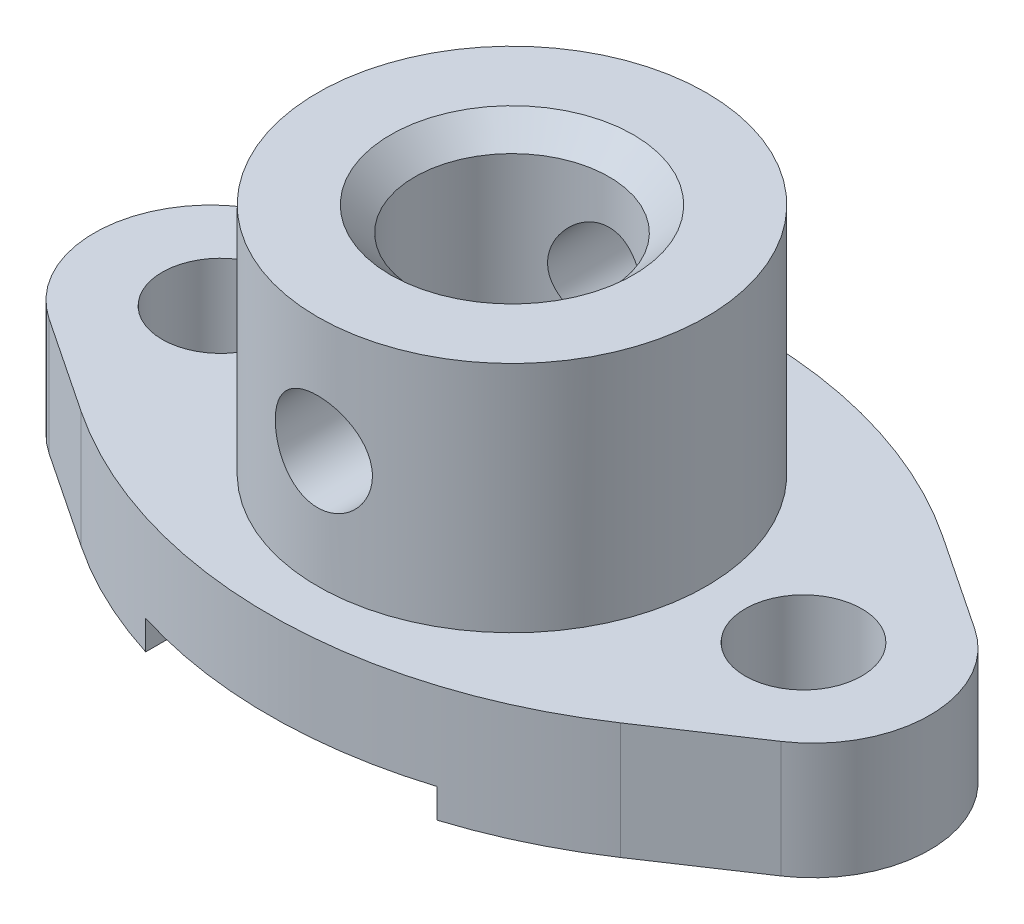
ISO-10303-21;
HEADER;
FILE_DESCRIPTION(('STEP AP214'),'2;1');
FILE_NAME('part.step','',(''),(''),'','','');
FILE_SCHEMA(('AUTOMOTIVE_DESIGN { 1 0 10303 214 1 1 1 1 }'));
ENDSEC;
DATA;
#1=APPLICATION_CONTEXT('core data for automotive mechanical design processes');
#2=APPLICATION_PROTOCOL_DEFINITION('international standard','automotive_design',2000,#1);
#3=PRODUCT_CONTEXT('',#1,'mechanical');
#4=PRODUCT('Part','Part','',(#3));
#5=PRODUCT_RELATED_PRODUCT_CATEGORY('part','',(#4));
#6=PRODUCT_DEFINITION_FORMATION('','',#4);
#7=PRODUCT_DEFINITION_CONTEXT('part definition',#1,'design');
#8=PRODUCT_DEFINITION('design','',#6,#7);
#9=PRODUCT_DEFINITION_SHAPE('','',#8);
#10=(LENGTH_UNIT() NAMED_UNIT(*) SI_UNIT(.MILLI.,.METRE.));
#11=(NAMED_UNIT(*) PLANE_ANGLE_UNIT() SI_UNIT($,.RADIAN.));
#12=(NAMED_UNIT(*) SI_UNIT($,.STERADIAN.) SOLID_ANGLE_UNIT());
#13=UNCERTAINTY_MEASURE_WITH_UNIT(LENGTH_MEASURE(1.E-05),#10,'distance_accuracy_value','');
#14=(GEOMETRIC_REPRESENTATION_CONTEXT(3) GLOBAL_UNCERTAINTY_ASSIGNED_CONTEXT((#13)) GLOBAL_UNIT_ASSIGNED_CONTEXT((#10,
#11,#12)) REPRESENTATION_CONTEXT('',''));
#15=CARTESIAN_POINT('',(0.,0.,0.));
#16=DIRECTION('',(0.,0.,1.));
#17=DIRECTION('',(1.,0.,0.));
#18=AXIS2_PLACEMENT_3D('',#15,#16,#17);
#19=CARTESIAN_POINT('',(-124.,48.,0.));
#20=DIRECTION('',(0.,-1.,0.));
#21=DIRECTION('',(0.,0.,-1.));
#22=AXIS2_PLACEMENT_3D('',#19,#20,#21);
#23=PLANE('',#22);
#24=CARTESIAN_POINT('',(-120.,48.,0.));
#25=DIRECTION('',(0.,1.,0.));
#26=DIRECTION('',(0.,0.,1.));
#27=AXIS2_PLACEMENT_3D('',#24,#25,#26);
#28=CIRCLE('',#27,24.);
#29=CARTESIAN_POINT('',(-120.,48.,24.));
#30=VERTEX_POINT('',#29);
#31=EDGE_CURVE('E302',#30,#30,#28,.T.);
#32=ORIENTED_EDGE('',*,*,#31,.F.);
#33=EDGE_LOOP('',(#32));
#34=FACE_BOUND('',#33,.T.);
#35=CARTESIAN_POINT('',(-124.,48.,0.));
#36=DIRECTION('',(0.,1.,0.));
#37=DIRECTION('',(0.,0.,-1.));
#38=AXIS2_PLACEMENT_3D('',#35,#36,#37);
#39=CIRCLE('',#38,48.);
#40=CARTESIAN_POINT('',(-150.635781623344,48.,-39.9316307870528));
#41=VERTEX_POINT('',#40);
#42=CARTESIAN_POINT('',(-150.635781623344,48.,39.9316307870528));
#43=VERTEX_POINT('',#42);
#44=EDGE_CURVE('E167',#41,#43,#39,.T.);
#45=ORIENTED_EDGE('',*,*,#44,.T.);
#46=DIRECTION('',(0.831908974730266,0.,0.554912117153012));
#47=VECTOR('',#46,1.);
#48=CARTESIAN_POINT('',(-150.635781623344,48.,39.9316307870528));
#49=LINE('',#48,#47);
#50=CARTESIAN_POINT('',(-110.982423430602,48.,66.3817949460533));
#51=VERTEX_POINT('',#50);
#52=EDGE_CURVE('E103',#43,#51,#49,.T.);
#53=ORIENTED_EDGE('',*,*,#52,.T.);
#54=CARTESIAN_POINT('',(0.,48.,-100.));
#55=DIRECTION('',(0.,1.,0.));
#56=DIRECTION('',(0.,0.,-1.));
#57=AXIS2_PLACEMENT_3D('',#54,#55,#56);
#58=CIRCLE('',#57,200.);
#59=CARTESIAN_POINT('',(110.982423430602,48.,66.3817949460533));
#60=VERTEX_POINT('',#59);
#61=EDGE_CURVE('E291',#51,#60,#58,.T.);
#62=ORIENTED_EDGE('',*,*,#61,.T.);
#63=DIRECTION('',(0.831908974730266,0.,-0.554912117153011));
#64=VECTOR('',#63,1.);
#65=CARTESIAN_POINT('',(110.982423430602,48.,66.3817949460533));
#66=LINE('',#65,#64);
#67=CARTESIAN_POINT('',(150.635781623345,48.,39.9316307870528));
#68=VERTEX_POINT('',#67);
#69=EDGE_CURVE('E293',#60,#68,#66,.T.);
#70=ORIENTED_EDGE('',*,*,#69,.T.);
#71=CARTESIAN_POINT('',(124.,48.,0.));
#72=DIRECTION('',(0.,1.,0.));
#73=DIRECTION('',(0.,0.,1.));
#74=AXIS2_PLACEMENT_3D('',#71,#72,#73);
#75=CIRCLE('',#74,48.);
#76=CARTESIAN_POINT('',(150.635781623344,48.,-39.9316307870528));
#77=VERTEX_POINT('',#76);
#78=EDGE_CURVE('E125',#68,#77,#75,.T.);
#79=ORIENTED_EDGE('',*,*,#78,.T.);
#80=DIRECTION('',(-0.831908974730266,0.,-0.554912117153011));
#81=VECTOR('',#80,1.);
#82=CARTESIAN_POINT('',(150.635781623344,48.,-39.9316307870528));
#83=LINE('',#82,#81);
#84=CARTESIAN_POINT('',(110.982423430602,48.,-66.3817949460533));
#85=VERTEX_POINT('',#84);
#86=EDGE_CURVE('E118',#77,#85,#83,.T.);
#87=ORIENTED_EDGE('',*,*,#86,.T.);
#88=CARTESIAN_POINT('',(0.,48.,100.));
#89=DIRECTION('',(0.,1.,0.));
#90=DIRECTION('',(0.,0.,1.));
#91=AXIS2_PLACEMENT_3D('',#88,#89,#90);
#92=CIRCLE('',#91,200.);
#93=CARTESIAN_POINT('',(-110.982423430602,48.,-66.3817949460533));
#94=VERTEX_POINT('',#93);
#95=EDGE_CURVE('E122',#85,#94,#92,.T.);
#96=ORIENTED_EDGE('',*,*,#95,.T.);
#97=DIRECTION('',(-0.831908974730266,0.,0.554912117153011));
#98=VECTOR('',#97,1.);
#99=CARTESIAN_POINT('',(-110.982423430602,48.,-66.3817949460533));
#100=LINE('',#99,#98);
#101=EDGE_CURVE('E61',#94,#41,#100,.T.);
#102=ORIENTED_EDGE('',*,*,#101,.T.);
#103=EDGE_LOOP('',(#45,#53,#62,#70,#79,#87,#96,#102));
#104=FACE_BOUND('',#103,.T.);
#105=CARTESIAN_POINT('',(120.,48.,0.));
#106=DIRECTION('',(0.,1.,0.));
#107=DIRECTION('',(0.,0.,1.));
#108=AXIS2_PLACEMENT_3D('',#105,#106,#107);
#109=CIRCLE('',#108,24.);
#110=CARTESIAN_POINT('',(120.,48.,24.));
#111=VERTEX_POINT('',#110);
#112=EDGE_CURVE('E152',#111,#111,#109,.T.);
#113=ORIENTED_EDGE('',*,*,#112,.F.);
#114=EDGE_LOOP('',(#113));
#115=FACE_BOUND('',#114,.T.);
#116=CARTESIAN_POINT('',(0.,48.,0.));
#117=DIRECTION('',(0.,-1.,0.));
#118=DIRECTION('',(0.,0.,-1.));
#119=AXIS2_PLACEMENT_3D('',#116,#117,#118);
#120=CIRCLE('',#119,80.);
#121=CARTESIAN_POINT('',(0.,48.,-80.));
#122=VERTEX_POINT('',#121);
#123=EDGE_CURVE('E188',#122,#122,#120,.F.);
#124=ORIENTED_EDGE('',*,*,#123,.F.);
#125=EDGE_LOOP('',(#124));
#126=FACE_BOUND('',#125,.T.);
#127=ADVANCED_FACE('F31',(#34,#104,#115,#126),#23,.F.);
#128=CARTESIAN_POINT('',(-124.,0.,0.));
#129=DIRECTION('',(0.,-1.,0.));
#130=DIRECTION('',(0.,0.,-1.));
#131=AXIS2_PLACEMENT_3D('',#128,#129,#130);
#132=PLANE('',#131);
#133=DIRECTION('',(0.,0.,-1.));
#134=VECTOR('',#133,1.);
#135=CARTESIAN_POINT('',(-60.,0.,0.));
#136=LINE('',#135,#134);
#137=CARTESIAN_POINT('',(-60.,0.,90.7878402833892));
#138=VERTEX_POINT('',#137);
#139=CARTESIAN_POINT('',(-60.,0.,-90.7878402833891));
#140=VERTEX_POINT('',#139);
#141=EDGE_CURVE('E312',#138,#140,#136,.T.);
#142=ORIENTED_EDGE('',*,*,#141,.F.);
#143=CARTESIAN_POINT('',(0.,0.,-100.));
#144=DIRECTION('',(0.,1.,0.));
#145=DIRECTION('',(0.,0.,-1.));
#146=AXIS2_PLACEMENT_3D('',#143,#144,#145);
#147=CIRCLE('',#146,200.);
#148=CARTESIAN_POINT('',(-110.982423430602,0.,66.3817949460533));
#149=VERTEX_POINT('',#148);
#150=EDGE_CURVE('E155',#149,#138,#147,.T.);
#151=ORIENTED_EDGE('',*,*,#150,.F.);
#152=DIRECTION('',(0.831908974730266,0.,0.554912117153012));
#153=VECTOR('',#152,1.);
#154=CARTESIAN_POINT('',(-150.635781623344,0.,39.9316307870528));
#155=LINE('',#154,#153);
#156=CARTESIAN_POINT('',(-150.635781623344,0.,39.9316307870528));
#157=VERTEX_POINT('',#156);
#158=EDGE_CURVE('E151',#157,#149,#155,.T.);
#159=ORIENTED_EDGE('',*,*,#158,.F.);
#160=CARTESIAN_POINT('',(-124.,0.,0.));
#161=DIRECTION('',(0.,1.,0.));
#162=DIRECTION('',(0.,0.,-1.));
#163=AXIS2_PLACEMENT_3D('',#160,#161,#162);
#164=CIRCLE('',#163,48.);
#165=CARTESIAN_POINT('',(-150.635781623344,0.,-39.9316307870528));
#166=VERTEX_POINT('',#165);
#167=EDGE_CURVE('E148',#166,#157,#164,.T.);
#168=ORIENTED_EDGE('',*,*,#167,.F.);
#169=DIRECTION('',(-0.831908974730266,0.,0.554912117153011));
#170=VECTOR('',#169,1.);
#171=CARTESIAN_POINT('',(-110.982423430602,0.,-66.3817949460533));
#172=LINE('',#171,#170);
#173=CARTESIAN_POINT('',(-110.982423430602,0.,-66.3817949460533));
#174=VERTEX_POINT('',#173);
#175=EDGE_CURVE('E94',#174,#166,#172,.T.);
#176=ORIENTED_EDGE('',*,*,#175,.F.);
#177=CARTESIAN_POINT('',(0.,0.,100.));
#178=DIRECTION('',(0.,1.,0.));
#179=DIRECTION('',(0.,0.,1.));
#180=AXIS2_PLACEMENT_3D('',#177,#178,#179);
#181=CIRCLE('',#180,200.);
#182=EDGE_CURVE('E163',#140,#174,#181,.T.);
#183=ORIENTED_EDGE('',*,*,#182,.F.);
#184=EDGE_LOOP('',(#142,#151,#159,#168,#176,#183));
#185=FACE_BOUND('',#184,.T.);
#186=CARTESIAN_POINT('',(-120.,0.,0.));
#187=DIRECTION('',(0.,1.,0.));
#188=DIRECTION('',(0.,0.,1.));
#189=AXIS2_PLACEMENT_3D('',#186,#187,#188);
#190=CIRCLE('',#189,24.);
#191=CARTESIAN_POINT('',(-120.,0.,24.));
#192=VERTEX_POINT('',#191);
#193=EDGE_CURVE('E305',#192,#192,#190,.T.);
#194=ORIENTED_EDGE('',*,*,#193,.T.);
#195=EDGE_LOOP('',(#194));
#196=FACE_BOUND('',#195,.T.);
#197=ADVANCED_FACE('F248',(#185,#196),#132,.T.);
#198=DIRECTION('',(0.,0.,1.));
#199=VECTOR('',#198,1.);
#200=CARTESIAN_POINT('',(60.,0.,0.));
#201=LINE('',#200,#199);
#202=CARTESIAN_POINT('',(60.,0.,-90.7878402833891));
#203=VERTEX_POINT('',#202);
#204=CARTESIAN_POINT('',(60.,0.,90.7878402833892));
#205=VERTEX_POINT('',#204);
#206=EDGE_CURVE('E320',#203,#205,#201,.T.);
#207=ORIENTED_EDGE('',*,*,#206,.F.);
#208=CARTESIAN_POINT('',(110.982423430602,0.,-66.3817949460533));
#209=VERTEX_POINT('',#208);
#210=EDGE_CURVE('E164',#209,#203,#181,.T.);
#211=ORIENTED_EDGE('',*,*,#210,.F.);
#212=DIRECTION('',(-0.831908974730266,0.,-0.554912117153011));
#213=VECTOR('',#212,1.);
#214=CARTESIAN_POINT('',(150.635781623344,0.,-39.9316307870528));
#215=LINE('',#214,#213);
#216=CARTESIAN_POINT('',(150.635781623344,0.,-39.9316307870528));
#217=VERTEX_POINT('',#216);
#218=EDGE_CURVE('E134',#217,#209,#215,.T.);
#219=ORIENTED_EDGE('',*,*,#218,.F.);
#220=CARTESIAN_POINT('',(124.,0.,0.));
#221=DIRECTION('',(0.,1.,0.));
#222=DIRECTION('',(0.,0.,1.));
#223=AXIS2_PLACEMENT_3D('',#220,#221,#222);
#224=CIRCLE('',#223,48.);
#225=CARTESIAN_POINT('',(150.635781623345,0.,39.9316307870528));
#226=VERTEX_POINT('',#225);
#227=EDGE_CURVE('E160',#226,#217,#224,.T.);
#228=ORIENTED_EDGE('',*,*,#227,.F.);
#229=DIRECTION('',(0.831908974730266,0.,-0.554912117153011));
#230=VECTOR('',#229,1.);
#231=CARTESIAN_POINT('',(110.982423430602,0.,66.3817949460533));
#232=LINE('',#231,#230);
#233=CARTESIAN_POINT('',(110.982423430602,0.,66.3817949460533));
#234=VERTEX_POINT('',#233);
#235=EDGE_CURVE('E158',#234,#226,#232,.T.);
#236=ORIENTED_EDGE('',*,*,#235,.F.);
#237=EDGE_CURVE('E154',#205,#234,#147,.T.);
#238=ORIENTED_EDGE('',*,*,#237,.F.);
#239=EDGE_LOOP('',(#207,#211,#219,#228,#236,#238));
#240=FACE_BOUND('',#239,.T.);
#241=CARTESIAN_POINT('',(120.,0.,0.));
#242=DIRECTION('',(0.,1.,0.));
#243=DIRECTION('',(0.,0.,1.));
#244=AXIS2_PLACEMENT_3D('',#241,#242,#243);
#245=CIRCLE('',#244,24.);
#246=CARTESIAN_POINT('',(120.,0.,24.));
#247=VERTEX_POINT('',#246);
#248=EDGE_CURVE('E299',#247,#247,#245,.T.);
#249=ORIENTED_EDGE('',*,*,#248,.T.);
#250=EDGE_LOOP('',(#249));
#251=FACE_BOUND('',#250,.T.);
#252=ADVANCED_FACE('F250',(#240,#251),#132,.T.);
#253=CARTESIAN_POINT('',(-124.,48.,0.));
#254=DIRECTION('',(0.,-1.,0.));
#255=DIRECTION('',(0.,0.,-1.));
#256=AXIS2_PLACEMENT_3D('',#253,#254,#255);
#257=CYLINDRICAL_SURFACE('',#256,48.);
#258=ORIENTED_EDGE('',*,*,#167,.T.);
#259=DIRECTION('',(0.,-1.,0.));
#260=VECTOR('',#259,1.);
#261=CARTESIAN_POINT('',(-150.635781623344,48.,39.9316307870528));
#262=LINE('',#261,#260);
#263=EDGE_CURVE('E180',#43,#157,#262,.T.);
#264=ORIENTED_EDGE('',*,*,#263,.F.);
#265=ORIENTED_EDGE('',*,*,#44,.F.);
#266=DIRECTION('',(0.,-1.,0.));
#267=VECTOR('',#266,1.);
#268=CARTESIAN_POINT('',(-150.635781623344,48.,-39.9316307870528));
#269=LINE('',#268,#267);
#270=EDGE_CURVE('E144',#41,#166,#269,.T.);
#271=ORIENTED_EDGE('',*,*,#270,.T.);
#272=EDGE_LOOP('',(#258,#264,#265,#271));
#273=FACE_BOUND('',#272,.T.);
#274=ADVANCED_FACE('F253',(#273),#257,.T.);
#275=CARTESIAN_POINT('',(-150.635781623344,48.,39.9316307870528));
#276=DIRECTION('',(0.554912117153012,0.,-0.831908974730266));
#277=DIRECTION('',(-0.831908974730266,0.,-0.554912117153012));
#278=AXIS2_PLACEMENT_3D('',#275,#276,#277);
#279=PLANE('',#278);
#280=ORIENTED_EDGE('',*,*,#158,.T.);
#281=DIRECTION('',(0.,-1.,0.));
#282=VECTOR('',#281,1.);
#283=CARTESIAN_POINT('',(-110.982423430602,48.,66.3817949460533));
#284=LINE('',#283,#282);
#285=EDGE_CURVE('E177',#51,#149,#284,.T.);
#286=ORIENTED_EDGE('',*,*,#285,.F.);
#287=ORIENTED_EDGE('',*,*,#52,.F.);
#288=ORIENTED_EDGE('',*,*,#263,.T.);
#289=EDGE_LOOP('',(#280,#286,#287,#288));
#290=FACE_BOUND('',#289,.T.);
#291=ADVANCED_FACE('F272',(#290),#279,.F.);
#292=CARTESIAN_POINT('',(0.,48.,-100.));
#293=DIRECTION('',(0.,-1.,0.));
#294=DIRECTION('',(0.,0.,-1.));
#295=AXIS2_PLACEMENT_3D('',#292,#293,#294);
#296=CYLINDRICAL_SURFACE('',#295,200.);
#297=CARTESIAN_POINT('',(0.,12.,-100.));
#298=DIRECTION('',(0.,1.,0.));
#299=DIRECTION('',(0.,0.,1.));
#300=AXIS2_PLACEMENT_3D('',#297,#298,#299);
#301=CIRCLE('',#300,200.);
#302=CARTESIAN_POINT('',(-60.,12.,90.7878402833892));
#303=VERTEX_POINT('',#302);
#304=CARTESIAN_POINT('',(60.,12.,90.7878402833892));
#305=VERTEX_POINT('',#304);
#306=EDGE_CURVE('E315',#303,#305,#301,.T.);
#307=ORIENTED_EDGE('',*,*,#306,.T.);
#308=DIRECTION('',(0.,-1.,0.));
#309=VECTOR('',#308,1.);
#310=CARTESIAN_POINT('',(60.,48.,90.7878402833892));
#311=LINE('',#310,#309);
#312=EDGE_CURVE('E317',#305,#205,#311,.T.);
#313=ORIENTED_EDGE('',*,*,#312,.T.);
#314=ORIENTED_EDGE('',*,*,#237,.T.);
#315=DIRECTION('',(0.,-1.,0.));
#316=VECTOR('',#315,1.);
#317=CARTESIAN_POINT('',(110.982423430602,48.,66.3817949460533));
#318=LINE('',#317,#316);
#319=EDGE_CURVE('E174',#60,#234,#318,.T.);
#320=ORIENTED_EDGE('',*,*,#319,.F.);
#321=ORIENTED_EDGE('',*,*,#61,.F.);
#322=ORIENTED_EDGE('',*,*,#285,.T.);
#323=ORIENTED_EDGE('',*,*,#150,.T.);
#324=DIRECTION('',(0.,-1.,0.));
#325=VECTOR('',#324,1.);
#326=CARTESIAN_POINT('',(-60.,48.,90.7878402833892));
#327=LINE('',#326,#325);
#328=EDGE_CURVE('E308',#138,#303,#327,.F.);
#329=ORIENTED_EDGE('',*,*,#328,.T.);
#330=EDGE_LOOP('',(#307,#313,#314,#320,#321,#322,#323,#329));
#331=FACE_BOUND('',#330,.T.);
#332=ADVANCED_FACE('F268',(#331),#296,.T.);
#333=CARTESIAN_POINT('',(110.982423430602,48.,66.3817949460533));
#334=DIRECTION('',(-0.554912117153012,0.,-0.831908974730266));
#335=DIRECTION('',(-0.831908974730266,0.,0.554912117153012));
#336=AXIS2_PLACEMENT_3D('',#333,#334,#335);
#337=PLANE('',#336);
#338=ORIENTED_EDGE('',*,*,#235,.T.);
#339=DIRECTION('',(0.,-1.,0.));
#340=VECTOR('',#339,1.);
#341=CARTESIAN_POINT('',(150.635781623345,48.,39.9316307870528));
#342=LINE('',#341,#340);
#343=EDGE_CURVE('E171',#68,#226,#342,.T.);
#344=ORIENTED_EDGE('',*,*,#343,.F.);
#345=ORIENTED_EDGE('',*,*,#69,.F.);
#346=ORIENTED_EDGE('',*,*,#319,.T.);
#347=EDGE_LOOP('',(#338,#344,#345,#346));
#348=FACE_BOUND('',#347,.T.);
#349=ADVANCED_FACE('F264',(#348),#337,.F.);
#350=CARTESIAN_POINT('',(124.,48.,0.));
#351=DIRECTION('',(0.,-1.,0.));
#352=DIRECTION('',(0.,0.,-1.));
#353=AXIS2_PLACEMENT_3D('',#350,#351,#352);
#354=CYLINDRICAL_SURFACE('',#353,48.);
#355=ORIENTED_EDGE('',*,*,#227,.T.);
#356=DIRECTION('',(0.,-1.,0.));
#357=VECTOR('',#356,1.);
#358=CARTESIAN_POINT('',(150.635781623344,48.,-39.9316307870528));
#359=LINE('',#358,#357);
#360=EDGE_CURVE('E138',#77,#217,#359,.T.);
#361=ORIENTED_EDGE('',*,*,#360,.F.);
#362=ORIENTED_EDGE('',*,*,#78,.F.);
#363=ORIENTED_EDGE('',*,*,#343,.T.);
#364=EDGE_LOOP('',(#355,#361,#362,#363));
#365=FACE_BOUND('',#364,.T.);
#366=ADVANCED_FACE('F261',(#365),#354,.T.);
#367=CARTESIAN_POINT('',(150.635781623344,48.,-39.9316307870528));
#368=DIRECTION('',(-0.554912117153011,0.,0.831908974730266));
#369=DIRECTION('',(0.831908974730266,0.,0.554912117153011));
#370=AXIS2_PLACEMENT_3D('',#367,#368,#369);
#371=PLANE('',#370);
#372=ORIENTED_EDGE('',*,*,#218,.T.);
#373=DIRECTION('',(0.,-1.,0.));
#374=VECTOR('',#373,1.);
#375=CARTESIAN_POINT('',(110.982423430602,48.,-66.3817949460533));
#376=LINE('',#375,#374);
#377=EDGE_CURVE('E131',#85,#209,#376,.T.);
#378=ORIENTED_EDGE('',*,*,#377,.F.);
#379=ORIENTED_EDGE('',*,*,#86,.F.);
#380=ORIENTED_EDGE('',*,*,#360,.T.);
#381=EDGE_LOOP('',(#372,#378,#379,#380));
#382=FACE_BOUND('',#381,.T.);
#383=ADVANCED_FACE('F132',(#382),#371,.F.);
#384=CARTESIAN_POINT('',(0.,48.,100.));
#385=DIRECTION('',(0.,-1.,0.));
#386=DIRECTION('',(0.,0.,-1.));
#387=AXIS2_PLACEMENT_3D('',#384,#385,#386);
#388=CYLINDRICAL_SURFACE('',#387,200.);
#389=DIRECTION('',(0.,-1.,0.));
#390=VECTOR('',#389,1.);
#391=CARTESIAN_POINT('',(60.,48.,-90.7878402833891));
#392=LINE('',#391,#390);
#393=CARTESIAN_POINT('',(60.,12.,-90.7878402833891));
#394=VERTEX_POINT('',#393);
#395=EDGE_CURVE('E186',#203,#394,#392,.F.);
#396=ORIENTED_EDGE('',*,*,#395,.T.);
#397=CARTESIAN_POINT('',(0.,12.,100.));
#398=DIRECTION('',(0.,1.,0.));
#399=DIRECTION('',(0.,0.,1.));
#400=AXIS2_PLACEMENT_3D('',#397,#398,#399);
#401=CIRCLE('',#400,200.);
#402=CARTESIAN_POINT('',(-60.,12.,-90.7878402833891));
#403=VERTEX_POINT('',#402);
#404=EDGE_CURVE('E52',#394,#403,#401,.T.);
#405=ORIENTED_EDGE('',*,*,#404,.T.);
#406=DIRECTION('',(0.,-1.,0.));
#407=VECTOR('',#406,1.);
#408=CARTESIAN_POINT('',(-60.,48.,-90.7878402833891));
#409=LINE('',#408,#407);
#410=EDGE_CURVE('E183',#403,#140,#409,.T.);
#411=ORIENTED_EDGE('',*,*,#410,.T.);
#412=ORIENTED_EDGE('',*,*,#182,.T.);
#413=DIRECTION('',(0.,-1.,0.));
#414=VECTOR('',#413,1.);
#415=CARTESIAN_POINT('',(-110.982423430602,48.,-66.3817949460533));
#416=LINE('',#415,#414);
#417=EDGE_CURVE('E139',#94,#174,#416,.T.);
#418=ORIENTED_EDGE('',*,*,#417,.F.);
#419=ORIENTED_EDGE('',*,*,#95,.F.);
#420=ORIENTED_EDGE('',*,*,#377,.T.);
#421=ORIENTED_EDGE('',*,*,#210,.T.);
#422=EDGE_LOOP('',(#396,#405,#411,#412,#418,#419,#420,#421));
#423=FACE_BOUND('',#422,.T.);
#424=ADVANCED_FACE('F142',(#423),#388,.T.);
#425=CARTESIAN_POINT('',(-110.982423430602,48.,-66.3817949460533));
#426=DIRECTION('',(0.554912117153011,0.,0.831908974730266));
#427=DIRECTION('',(0.831908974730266,0.,-0.554912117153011));
#428=AXIS2_PLACEMENT_3D('',#425,#426,#427);
#429=PLANE('',#428);
#430=ORIENTED_EDGE('',*,*,#175,.T.);
#431=ORIENTED_EDGE('',*,*,#270,.F.);
#432=ORIENTED_EDGE('',*,*,#101,.F.);
#433=ORIENTED_EDGE('',*,*,#417,.T.);
#434=EDGE_LOOP('',(#430,#431,#432,#433));
#435=FACE_BOUND('',#434,.T.);
#436=ADVANCED_FACE('F244',(#435),#429,.F.);
#437=CARTESIAN_POINT('',(120.,48.,0.));
#438=DIRECTION('',(0.,-1.,0.));
#439=DIRECTION('',(0.,0.,-1.));
#440=AXIS2_PLACEMENT_3D('',#437,#438,#439);
#441=CYLINDRICAL_SURFACE('',#440,24.);
#442=ORIENTED_EDGE('',*,*,#112,.T.);
#443=EDGE_LOOP('',(#442));
#444=FACE_BOUND('',#443,.T.);
#445=ORIENTED_EDGE('',*,*,#248,.F.);
#446=EDGE_LOOP('',(#445));
#447=FACE_BOUND('',#446,.T.);
#448=ADVANCED_FACE('F240',(#444,#447),#441,.F.);
#449=CARTESIAN_POINT('',(-120.,48.,0.));
#450=DIRECTION('',(0.,-1.,0.));
#451=DIRECTION('',(0.,0.,-1.));
#452=AXIS2_PLACEMENT_3D('',#449,#450,#451);
#453=CYLINDRICAL_SURFACE('',#452,24.);
#454=ORIENTED_EDGE('',*,*,#31,.T.);
#455=EDGE_LOOP('',(#454));
#456=FACE_BOUND('',#455,.T.);
#457=ORIENTED_EDGE('',*,*,#193,.F.);
#458=EDGE_LOOP('',(#457));
#459=FACE_BOUND('',#458,.T.);
#460=ADVANCED_FACE('F236',(#456,#459),#453,.F.);
#461=CARTESIAN_POINT('',(-60.,12.,-100.));
#462=DIRECTION('',(-1.,0.,0.));
#463=DIRECTION('',(0.,0.,1.));
#464=AXIS2_PLACEMENT_3D('',#461,#462,#463);
#465=PLANE('',#464);
#466=ORIENTED_EDGE('',*,*,#141,.T.);
#467=ORIENTED_EDGE('',*,*,#410,.F.);
#468=DIRECTION('',(0.,0.,1.));
#469=VECTOR('',#468,1.);
#470=CARTESIAN_POINT('',(-60.,12.,-100.));
#471=LINE('',#470,#469);
#472=EDGE_CURVE('E323',#403,#303,#471,.T.);
#473=ORIENTED_EDGE('',*,*,#472,.T.);
#474=ORIENTED_EDGE('',*,*,#328,.F.);
#475=EDGE_LOOP('',(#466,#467,#473,#474));
#476=FACE_BOUND('',#475,.T.);
#477=ADVANCED_FACE('F229',(#476),#465,.F.);
#478=CARTESIAN_POINT('',(-60.,12.,-100.));
#479=DIRECTION('',(0.,1.,0.));
#480=DIRECTION('',(0.,0.,1.));
#481=AXIS2_PLACEMENT_3D('',#478,#479,#480);
#482=PLANE('',#481);
#483=CARTESIAN_POINT('',(0.,12.,0.));
#484=DIRECTION('',(0.,1.,0.));
#485=DIRECTION('',(0.,0.,1.));
#486=AXIS2_PLACEMENT_3D('',#483,#484,#485);
#487=CIRCLE('',#486,40.);
#488=CARTESIAN_POINT('',(0.,12.,40.));
#489=VERTEX_POINT('',#488);
#490=EDGE_CURVE('E330',#489,#489,#487,.T.);
#491=ORIENTED_EDGE('',*,*,#490,.T.);
#492=EDGE_LOOP('',(#491));
#493=FACE_BOUND('',#492,.T.);
#494=ORIENTED_EDGE('',*,*,#306,.F.);
#495=ORIENTED_EDGE('',*,*,#472,.F.);
#496=ORIENTED_EDGE('',*,*,#404,.F.);
#497=DIRECTION('',(0.,0.,1.));
#498=VECTOR('',#497,1.);
#499=CARTESIAN_POINT('',(60.,12.,-100.));
#500=LINE('',#499,#498);
#501=EDGE_CURVE('E324',#394,#305,#500,.T.);
#502=ORIENTED_EDGE('',*,*,#501,.T.);
#503=EDGE_LOOP('',(#494,#495,#496,#502));
#504=FACE_BOUND('',#503,.T.);
#505=ADVANCED_FACE('F225',(#493,#504),#482,.F.);
#506=CARTESIAN_POINT('',(60.,12.,-100.));
#507=DIRECTION('',(1.,0.,0.));
#508=DIRECTION('',(0.,0.,-1.));
#509=AXIS2_PLACEMENT_3D('',#506,#507,#508);
#510=PLANE('',#509);
#511=ORIENTED_EDGE('',*,*,#501,.F.);
#512=ORIENTED_EDGE('',*,*,#395,.F.);
#513=ORIENTED_EDGE('',*,*,#206,.T.);
#514=ORIENTED_EDGE('',*,*,#312,.F.);
#515=EDGE_LOOP('',(#511,#512,#513,#514));
#516=FACE_BOUND('',#515,.T.);
#517=ADVANCED_FACE('F223',(#516),#510,.F.);
#518=CARTESIAN_POINT('',(0.,144.,0.));
#519=DIRECTION('',(0.,-1.,0.));
#520=DIRECTION('',(0.,0.,-1.));
#521=AXIS2_PLACEMENT_3D('',#518,#519,#520);
#522=CYLINDRICAL_SURFACE('',#521,80.);
#523=CARTESIAN_POINT('',(0.,116.,-80.));
#524=CARTESIAN_POINT('',(-0.552553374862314,115.999997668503,-79.9999986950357));
#525=CARTESIAN_POINT('',(-1.10515356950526,115.977082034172,-79.9942610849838));
#526=CARTESIAN_POINT('',(-2.20636296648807,115.885605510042,-79.9714660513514));
#527=CARTESIAN_POINT('',(-2.75497170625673,115.817039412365,-79.9544073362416));
#528=CARTESIAN_POINT('',(-3.84448035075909,115.634794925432,-79.9094323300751));
#529=CARTESIAN_POINT('',(-4.38537620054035,115.521093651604,-79.8815105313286));
#530=CARTESIAN_POINT('',(-5.45531134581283,115.249524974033,-79.8155804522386));
#531=CARTESIAN_POINT('',(-5.98435094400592,115.091658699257,-79.7775724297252));
#532=CARTESIAN_POINT('',(-7.02629056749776,114.733243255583,-79.692560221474));
#533=CARTESIAN_POINT('',(-7.53920942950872,114.532746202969,-79.6455670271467));
#534=CARTESIAN_POINT('',(-8.54613454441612,114.090493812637,-79.5438224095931));
#535=CARTESIAN_POINT('',(-9.04014069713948,113.848738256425,-79.4890709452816));
#536=CARTESIAN_POINT('',(-10.006009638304,113.325743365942,-79.3732724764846));
#537=CARTESIAN_POINT('',(-10.4778724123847,113.044504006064,-79.3122254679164));
#538=CARTESIAN_POINT('',(-11.3964465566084,112.444511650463,-79.1854532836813));
#539=CARTESIAN_POINT('',(-11.8431575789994,112.125758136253,-79.1197280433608));
#540=CARTESIAN_POINT('',(-12.7166269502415,111.446652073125,-78.9840892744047));
#541=CARTESIAN_POINT('',(-13.1428634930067,111.085639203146,-78.9141207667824));
#542=CARTESIAN_POINT('',(-13.9635663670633,110.329347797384,-78.7730425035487));
#543=CARTESIAN_POINT('',(-14.358032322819,109.934068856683,-78.7019327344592));
#544=CARTESIAN_POINT('',(-15.1126515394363,109.111795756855,-78.5605192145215));
#545=CARTESIAN_POINT('',(-15.4728010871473,108.684798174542,-78.490215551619));
#546=CARTESIAN_POINT('',(-16.1563281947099,107.801895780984,-78.3523749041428));
#547=CARTESIAN_POINT('',(-16.4797055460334,107.345990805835,-78.2848379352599));
#548=CARTESIAN_POINT('',(-17.0919754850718,106.401245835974,-78.1534638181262));
#549=CARTESIAN_POINT('',(-17.3802827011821,105.912016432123,-78.0896967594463));
#550=CARTESIAN_POINT('',(-17.9145598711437,104.910153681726,-77.9688630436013));
#551=CARTESIAN_POINT('',(-18.1605292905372,104.397520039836,-77.9117964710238));
#552=CARTESIAN_POINT('',(-18.6081694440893,103.352489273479,-77.8060984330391));
#553=CARTESIAN_POINT('',(-18.8098456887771,102.820094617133,-77.7574659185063));
#554=CARTESIAN_POINT('',(-19.167269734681,101.739312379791,-77.6701336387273));
#555=CARTESIAN_POINT('',(-19.3230186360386,101.190925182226,-77.6314336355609));
#556=CARTESIAN_POINT('',(-19.5846005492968,100.093324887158,-77.5658510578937));
#557=CARTESIAN_POINT('',(-19.6913708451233,99.5443483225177,-77.5387473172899));
#558=CARTESIAN_POINT('',(-19.8586008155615,98.4389402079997,-77.4960866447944));
#559=CARTESIAN_POINT('',(-19.9190610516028,97.8825087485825,-77.4805295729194));
#560=CARTESIAN_POINT('',(-19.9931329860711,96.7664093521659,-77.4614491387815));
#561=CARTESIAN_POINT('',(-20.0067513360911,96.2067418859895,-77.4579240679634));
#562=CARTESIAN_POINT('',(-19.9870360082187,95.0882943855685,-77.4630137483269));
#563=CARTESIAN_POINT('',(-19.9537029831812,94.5295143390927,-77.4716283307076));
#564=CARTESIAN_POINT('',(-19.841761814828,93.430539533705,-77.5003723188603));
#565=CARTESIAN_POINT('',(-19.7642724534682,92.8902229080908,-77.5202171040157));
#566=CARTESIAN_POINT('',(-19.5655280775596,91.8182210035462,-77.5706168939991));
#567=CARTESIAN_POINT('',(-19.4442738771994,91.2865355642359,-77.6011716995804));
#568=CARTESIAN_POINT('',(-19.1589731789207,90.2354246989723,-77.6721013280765));
#569=CARTESIAN_POINT('',(-18.994924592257,89.7159998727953,-77.7124766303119));
#570=CARTESIAN_POINT('',(-18.6253121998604,88.6929080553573,-77.8018885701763));
#571=CARTESIAN_POINT('',(-18.4197477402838,88.1892413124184,-77.8509253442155));
#572=CARTESIAN_POINT('',(-17.9663570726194,87.1959638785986,-77.9568131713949));
#573=CARTESIAN_POINT('',(-17.718125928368,86.7065459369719,-78.0137379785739));
#574=CARTESIAN_POINT('',(-17.1826589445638,85.7502911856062,-78.133420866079));
#575=CARTESIAN_POINT('',(-16.8954229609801,85.2834544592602,-78.196178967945));
#576=CARTESIAN_POINT('',(-16.2838786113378,84.3752396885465,-78.3258129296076));
#577=CARTESIAN_POINT('',(-15.9595648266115,83.9338653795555,-78.3926893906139));
#578=CARTESIAN_POINT('',(-15.2760389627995,83.07939702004,-78.5287465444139));
#579=CARTESIAN_POINT('',(-14.9168262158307,82.6663035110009,-78.5979272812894));
#580=CARTESIAN_POINT('',(-14.1550737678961,81.8596200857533,-78.7387332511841));
#581=CARTESIAN_POINT('',(-13.7515900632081,81.4669233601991,-78.8103718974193));
#582=CARTESIAN_POINT('',(-12.9128067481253,80.7168068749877,-78.9521393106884));
#583=CARTESIAN_POINT('',(-12.4775065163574,80.3593878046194,-79.0222680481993));
#584=CARTESIAN_POINT('',(-11.5779456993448,79.6822765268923,-79.1590684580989));
#585=CARTESIAN_POINT('',(-11.113683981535,79.3625857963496,-79.2257399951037));
#586=CARTESIAN_POINT('',(-10.1593031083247,78.7632349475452,-79.3537669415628));
#587=CARTESIAN_POINT('',(-9.66918411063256,78.4835745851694,-79.4151223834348));
#588=CARTESIAN_POINT('',(-8.66465976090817,77.9654736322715,-79.5310011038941));
#589=CARTESIAN_POINT('',(-8.15017608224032,77.7271793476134,-79.5854999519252));
#590=CARTESIAN_POINT('',(-7.10209907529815,77.2948798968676,-79.685866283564));
#591=CARTESIAN_POINT('',(-6.56850563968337,77.1008749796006,-79.7317337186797));
#592=CARTESIAN_POINT('',(-5.48613684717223,76.7587842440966,-79.8135125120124));
#593=CARTESIAN_POINT('',(-4.93736386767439,76.6106912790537,-79.8494254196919));
#594=CARTESIAN_POINT('',(-3.82862493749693,76.3616590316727,-79.9102611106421));
#595=CARTESIAN_POINT('',(-3.26865926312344,76.2607185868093,-79.9351841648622));
#596=CARTESIAN_POINT('',(-2.1562094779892,76.1088510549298,-79.9728237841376));
#597=CARTESIAN_POINT('',(-1.60390089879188,76.0567096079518,-79.9858365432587));
#598=CARTESIAN_POINT('',(-0.496713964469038,75.9984857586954,-80.0003735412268));
#599=CARTESIAN_POINT('',(0.0581643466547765,75.9924025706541,-80.0018979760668));
#600=CARTESIAN_POINT('',(1.16637153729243,76.0263454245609,-79.9934160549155));
#601=CARTESIAN_POINT('',(1.71970054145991,76.0663676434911,-79.9834106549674));
#602=CARTESIAN_POINT('',(2.82080714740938,76.1921705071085,-79.9521507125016));
#603=CARTESIAN_POINT('',(3.3685847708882,76.2779509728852,-79.9308962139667));
#604=CARTESIAN_POINT('',(4.44655600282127,76.4929317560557,-79.8781261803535));
#605=CARTESIAN_POINT('',(4.97688994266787,76.6214681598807,-79.8467677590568));
#606=CARTESIAN_POINT('',(6.0246819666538,76.9212124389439,-79.7745510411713));
#607=CARTESIAN_POINT('',(6.54214021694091,77.0924197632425,-79.7336928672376));
#608=CARTESIAN_POINT('',(7.56075993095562,77.476200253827,-79.6435583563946));
#609=CARTESIAN_POINT('',(8.06192019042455,77.688776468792,-79.594281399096));
#610=CARTESIAN_POINT('',(9.04464926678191,78.1537169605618,-79.488606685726));
#611=CARTESIAN_POINT('',(9.52621772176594,78.4060819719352,-79.4322087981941));
#612=CARTESIAN_POINT('',(10.4750517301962,78.9536334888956,-79.3127101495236));
#613=CARTESIAN_POINT('',(10.9419120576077,79.2495001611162,-79.2495082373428));
#614=CARTESIAN_POINT('',(11.849171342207,79.8785282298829,-79.1189435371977));
#615=CARTESIAN_POINT('',(12.2895700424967,80.2116899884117,-79.0515807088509));
#616=CARTESIAN_POINT('',(13.1411743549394,80.9131219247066,-78.9144828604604));
#617=CARTESIAN_POINT('',(13.5523755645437,81.2813973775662,-78.8447474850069));
#618=CARTESIAN_POINT('',(14.3429051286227,82.050618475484,-78.7047790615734));
#619=CARTESIAN_POINT('',(14.7222330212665,82.4515645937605,-78.6345460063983));
#620=CARTESIAN_POINT('',(15.4554827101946,83.293804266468,-78.4937632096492));
#621=CARTESIAN_POINT('',(15.8085508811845,83.7358473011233,-78.4232481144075));
#622=CARTESIAN_POINT('',(16.4762179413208,84.6486132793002,-78.285697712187));
#623=CARTESIAN_POINT('',(16.7908161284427,85.1193367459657,-78.2186624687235));
#624=CARTESIAN_POINT('',(17.3792647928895,86.0862993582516,-78.0900243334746));
#625=CARTESIAN_POINT('',(17.6531162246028,86.5825379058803,-78.028421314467));
#626=CARTESIAN_POINT('',(18.1580075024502,87.5971529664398,-77.9124758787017));
#627=CARTESIAN_POINT('',(18.38904794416,88.1155291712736,-77.8581333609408));
#628=CARTESIAN_POINT('',(18.8052327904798,89.1676269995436,-77.758657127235));
#629=CARTESIAN_POINT('',(18.9906442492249,89.701237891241,-77.7134701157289));
#630=CARTESIAN_POINT('',(19.3158302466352,90.7829463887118,-77.6332839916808));
#631=CARTESIAN_POINT('',(19.45560484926,91.3310439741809,-77.5982848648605));
#632=CARTESIAN_POINT('',(19.6882921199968,92.4375934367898,-77.5395742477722));
#633=CARTESIAN_POINT('',(19.7812133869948,92.9960433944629,-77.5158606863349));
#634=CARTESIAN_POINT('',(19.9194035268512,94.1191826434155,-77.4804651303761));
#635=CARTESIAN_POINT('',(19.9646735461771,94.6838717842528,-77.4687828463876));
#636=CARTESIAN_POINT('',(20.006544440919,95.7988950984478,-77.4579796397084));
#637=CARTESIAN_POINT('',(20.0045072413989,96.3491751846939,-77.4585072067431));
#638=CARTESIAN_POINT('',(19.955119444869,97.4475538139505,-77.471245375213));
#639=CARTESIAN_POINT('',(19.9077697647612,97.9956524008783,-77.483455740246));
#640=CARTESIAN_POINT('',(19.7681649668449,99.0857059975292,-77.5191900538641));
#641=CARTESIAN_POINT('',(19.6759110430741,99.6276611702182,-77.5427137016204));
#642=CARTESIAN_POINT('',(19.447271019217,100.701602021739,-77.6003706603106));
#643=CARTESIAN_POINT('',(19.3108846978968,101.23358765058,-77.6345040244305));
#644=CARTESIAN_POINT('',(18.9960334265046,102.280752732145,-77.7121406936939));
#645=CARTESIAN_POINT('',(18.8178253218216,102.796013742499,-77.7555866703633));
#646=CARTESIAN_POINT('',(18.4202695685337,103.809611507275,-77.8507251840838));
#647=CARTESIAN_POINT('',(18.2009222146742,104.30794838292,-77.9024176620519));
#648=CARTESIAN_POINT('',(17.7226695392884,105.284537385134,-78.0126090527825));
#649=CARTESIAN_POINT('',(17.4637600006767,105.762787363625,-78.0711086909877));
#650=CARTESIAN_POINT('',(16.9082059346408,106.696146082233,-78.193308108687));
#651=CARTESIAN_POINT('',(16.6115606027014,107.151254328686,-78.2570079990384));
#652=CARTESIAN_POINT('',(15.9743007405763,108.047061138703,-78.3896061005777));
#653=CARTESIAN_POINT('',(15.6327408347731,108.487073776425,-78.4585965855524));
#654=CARTESIAN_POINT('',(14.914279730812,109.336937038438,-78.5983342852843));
#655=CARTESIAN_POINT('',(14.5373779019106,109.746787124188,-78.6690815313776));
#656=CARTESIAN_POINT('',(13.7506188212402,110.533758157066,-78.8104067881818));
#657=CARTESIAN_POINT('',(13.3407540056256,110.910871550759,-78.8809847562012));
#658=CARTESIAN_POINT('',(12.4907989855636,111.62977137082,-79.0200312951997));
#659=CARTESIAN_POINT('',(12.0507088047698,111.971557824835,-79.0884998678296));
#660=CARTESIAN_POINT('',(11.1349030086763,112.623342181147,-79.2226730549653));
#661=CARTESIAN_POINT('',(10.6586860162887,112.932651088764,-79.2883050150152));
#662=CARTESIAN_POINT('',(9.68106108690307,113.509977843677,-79.4136001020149));
#663=CARTESIAN_POINT('',(9.17965196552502,113.777993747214,-79.4732629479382));
#664=CARTESIAN_POINT('',(8.15546639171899,114.270496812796,-79.5848826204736));
#665=CARTESIAN_POINT('',(7.6327038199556,114.495011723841,-79.6368443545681));
#666=CARTESIAN_POINT('',(6.5692627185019,114.898893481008,-79.731609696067));
#667=CARTESIAN_POINT('',(6.02858690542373,115.07826713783,-79.7744146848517));
#668=CARTESIAN_POINT('',(5.03666361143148,115.360928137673,-79.8425357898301));
#669=CARTESIAN_POINT('',(4.58778986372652,115.472185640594,-79.8696278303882));
#670=CARTESIAN_POINT('',(3.68291121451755,115.663418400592,-79.9164651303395));
#671=CARTESIAN_POINT('',(3.22690458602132,115.743385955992,-79.9362085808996));
#672=CARTESIAN_POINT('',(2.31020380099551,115.871515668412,-79.9679515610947));
#673=CARTESIAN_POINT('',(1.84950992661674,115.919679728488,-79.9799515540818));
#674=CARTESIAN_POINT('',(0.925887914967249,115.983918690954,-79.9959752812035));
#675=CARTESIAN_POINT('',(0.462960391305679,116.00000195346,-80.0000010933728));
#676=CARTESIAN_POINT('',(0.,116.,-80.));
#677=B_SPLINE_CURVE_WITH_KNOTS('',3,(#523,#524,#525,#526,#527,#528,#529,#530,#531,#532,#533,
#534,#535,#536,#537,#538,#539,#540,#541,#542,#543,#544,#545,#546,#547,#548,#549,#550,#551,#552,
#553,#554,#555,#556,#557,#558,#559,#560,#561,#562,#563,#564,#565,#566,#567,#568,#569,#570,#571,
#572,#573,#574,#575,#576,#577,#578,#579,#580,#581,#582,#583,#584,#585,#586,#587,#588,#589,#590,
#591,#592,#593,#594,#595,#596,#597,#598,#599,#600,#601,#602,#603,#604,#605,#606,#607,#608,#609,
#610,#611,#612,#613,#614,#615,#616,#617,#618,#619,#620,#621,#622,#623,#624,#625,#626,#627,#628,
#629,#630,#631,#632,#633,#634,#635,#636,#637,#638,#639,#640,#641,#642,#643,#644,#645,#646,#647,
#648,#649,#650,#651,#652,#653,#654,#655,#656,#657,#658,#659,#660,#661,#662,#663,#664,#665,#666,
#667,#668,#669,#670,#671,#672,#673,#674,#675,#676),.UNSPECIFIED.,.T.,.F.,(4,2,2,2,2,2,2,2,2,2,2,
2,2,2,2,2,2,2,2,2,2,2,2,2,2,2,2,2,2,2,2,2,2,2,2,2,2,2,2,2,2,2,2,2,2,2,2,2,2,2,2,2,2,2,2,2,2,2,2,
2,2,2,2,2,2,2,2,2,2,2,2,2,2,2,2,2,4),(0.,1.65723817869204,3.31466545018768,4.97293415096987,
6.63116046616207,8.28737113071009,9.94359056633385,11.5998110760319,13.2560544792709,
14.9429290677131,16.6298235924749,18.3169004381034,20.0039868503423,21.7162015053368,
23.4284377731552,25.140460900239,26.8524430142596,28.5301358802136,30.2078084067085,
31.8852426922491,33.5626536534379,35.1993423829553,36.8360006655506,38.4727388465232,
40.1095028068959,41.7627578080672,43.4160189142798,45.0695219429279,46.7230566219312,
48.4237862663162,50.1245491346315,51.8253785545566,53.5261976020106,55.2329147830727,
56.9396415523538,58.6461025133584,60.3525214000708,62.0152494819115,63.6779491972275,
65.3405110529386,67.0030664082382,68.6409251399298,70.2787627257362,71.9167210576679,
73.5547096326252,75.2217529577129,76.8888124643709,78.5561228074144,80.2234573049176,
81.9317734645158,83.6401207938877,85.3484281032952,87.0567116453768,88.7547456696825,
90.4527773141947,92.1504972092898,93.8481762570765,95.4970431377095,97.1458766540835,
98.7946663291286,100.443464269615,102.08238965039,103.7213032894,105.360391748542,
106.999515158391,108.681411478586,110.363337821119,112.045651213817,113.727963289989,
115.440788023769,117.153693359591,118.86550242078,120.577053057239,121.965684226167,
123.354656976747,124.74354660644,126.132074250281),.UNSPECIFIED.);
#678=CARTESIAN_POINT('',(0.,116.,-80.));
#679=VERTEX_POINT('',#678);
#680=EDGE_CURVE('E214',#679,#679,#677,.T.);
#681=ORIENTED_EDGE('',*,*,#680,.T.);
#682=EDGE_LOOP('',(#681));
#683=FACE_BOUND('',#682,.T.);
#684=CARTESIAN_POINT('',(20.,96.,77.4596669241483));
#685=CARTESIAN_POINT('',(19.9999976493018,95.4477505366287,77.45966837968));
#686=CARTESIAN_POINT('',(19.9771070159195,94.895454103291,77.4655889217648));
#687=CARTESIAN_POINT('',(19.8857326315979,93.7948608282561,77.4890948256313));
#688=CARTESIAN_POINT('',(19.8172436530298,93.2465644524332,77.5066815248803));
#689=CARTESIAN_POINT('',(19.6352098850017,92.1576861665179,77.5529970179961));
#690=CARTESIAN_POINT('',(19.5216416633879,91.6171084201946,77.5817316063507));
#691=CARTESIAN_POINT('',(19.2504012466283,90.5478171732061,77.6494788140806));
#692=CARTESIAN_POINT('',(19.092730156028,90.0191033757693,77.6884911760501));
#693=CARTESIAN_POINT('',(18.7347858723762,88.9778573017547,77.7755851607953));
#694=CARTESIAN_POINT('',(18.5345686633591,88.465304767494,77.8236548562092));
#695=CARTESIAN_POINT('',(18.0929438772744,87.4590824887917,77.9275099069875));
#696=CARTESIAN_POINT('',(17.8515360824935,86.9654128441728,77.983295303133));
#697=CARTESIAN_POINT('',(17.3292908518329,86.0001600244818,78.1010069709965));
#698=CARTESIAN_POINT('',(17.0484530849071,85.5285770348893,78.1629332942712));
#699=CARTESIAN_POINT('',(16.4493016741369,84.6104891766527,78.2912147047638));
#700=CARTESIAN_POINT('',(16.1309874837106,84.1639846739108,78.3575698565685));
#701=CARTESIAN_POINT('',(15.4523295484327,83.2902579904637,78.4942523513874));
#702=CARTESIAN_POINT('',(15.0912769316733,82.863594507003,78.5646323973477));
#703=CARTESIAN_POINT('',(14.3348154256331,82.0420317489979,78.7061693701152));
#704=CARTESIAN_POINT('',(13.9394061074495,81.6471328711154,78.7773263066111));
#705=CARTESIAN_POINT('',(13.1167851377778,80.8916635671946,78.9184647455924));
#706=CARTESIAN_POINT('',(12.6895706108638,80.531096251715,78.9884461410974));
#707=CARTESIAN_POINT('',(11.8061470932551,79.8467625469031,79.125309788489));
#708=CARTESIAN_POINT('',(11.349937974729,79.5229963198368,79.1921920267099));
#709=CARTESIAN_POINT('',(10.4049316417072,78.9102685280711,79.3219262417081));
#710=CARTESIAN_POINT('',(9.91576778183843,78.6218573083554,79.3847087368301));
#711=CARTESIAN_POINT('',(8.91402460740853,78.087366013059,79.5034246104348));
#712=CARTESIAN_POINT('',(8.40144500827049,77.8412864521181,79.5593579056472));
#713=CARTESIAN_POINT('',(7.35652241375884,77.3934247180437,79.6627714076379));
#714=CARTESIAN_POINT('',(6.82418167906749,77.191637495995,79.7102525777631));
#715=CARTESIAN_POINT('',(5.74352539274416,76.8339930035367,79.7953985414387));
#716=CARTESIAN_POINT('',(5.19521021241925,76.6781346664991,79.8330635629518));
#717=CARTESIAN_POINT('',(4.0979017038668,76.4163618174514,79.8968278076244));
#718=CARTESIAN_POINT('',(3.54914710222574,76.3094995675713,79.9231458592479));
#719=CARTESIAN_POINT('',(2.44420188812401,76.1420520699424,79.9645640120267));
#720=CARTESIAN_POINT('',(1.88801136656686,76.081466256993,79.9796642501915));
#721=CARTESIAN_POINT('',(0.772387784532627,76.0071033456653,79.9982163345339));
#722=CARTESIAN_POINT('',(0.212955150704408,75.9933202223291,80.0016696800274));
#723=CARTESIAN_POINT('',(-0.905043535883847,76.0126675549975,79.9968334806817));
#724=CARTESIAN_POINT('',(-1.46360959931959,76.045797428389,79.9885440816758));
#725=CARTESIAN_POINT('',(-2.56334384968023,76.1574213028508,79.9607722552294));
#726=CARTESIAN_POINT('',(-3.10462280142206,76.2348907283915,79.9415426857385));
#727=CARTESIAN_POINT('',(-4.17855638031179,76.433756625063,79.892606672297));
#728=CARTESIAN_POINT('',(-4.71121115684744,76.5551523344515,79.8629004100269));
#729=CARTESIAN_POINT('',(-5.76423944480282,76.8408979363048,79.793809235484));
#730=CARTESIAN_POINT('',(-6.28461254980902,77.0052492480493,79.7544240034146));
#731=CARTESIAN_POINT('',(-7.30956043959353,77.3756271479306,79.6670251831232));
#732=CARTESIAN_POINT('',(-7.81413499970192,77.5816543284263,79.6190114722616));
#733=CARTESIAN_POINT('',(-8.80864085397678,78.0358863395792,79.5151562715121));
#734=CARTESIAN_POINT('',(-9.29839908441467,78.2844547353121,79.4592481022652));
#735=CARTESIAN_POINT('',(-10.2552789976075,78.8206506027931,79.3414246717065));
#736=CARTESIAN_POINT('',(-10.7224006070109,79.1082782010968,79.2795093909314));
#737=CARTESIAN_POINT('',(-11.6311098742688,79.7206414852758,79.1512974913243));
#738=CARTESIAN_POINT('',(-12.0726938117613,80.045382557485,79.0850002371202));
#739=CARTESIAN_POINT('',(-12.9274947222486,80.7297783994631,78.9497762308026));
#740=CARTESIAN_POINT('',(-13.3407111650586,81.0894338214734,78.8808494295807));
#741=CARTESIAN_POINT('',(-14.1469748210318,81.8515342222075,78.7403015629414));
#742=CARTESIAN_POINT('',(-14.5391724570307,82.2548744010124,78.6686580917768));
#743=CARTESIAN_POINT('',(-15.2883058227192,83.0932675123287,78.5265121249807));
#744=CARTESIAN_POINT('',(-15.6452408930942,83.5283210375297,78.4560096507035));
#745=CARTESIAN_POINT('',(-16.321426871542,84.4273001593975,78.3181341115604));
#746=CARTESIAN_POINT('',(-16.6406757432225,84.8912273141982,78.2507612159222));
#747=CARTESIAN_POINT('',(-17.239202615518,85.8448632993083,78.1210835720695));
#748=CARTESIAN_POINT('',(-17.5184808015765,86.33457200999,78.0587788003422));
#749=CARTESIAN_POINT('',(-18.0362602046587,87.3389335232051,77.9407737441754));
#750=CARTESIAN_POINT('',(-18.2745555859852,87.8536964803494,77.8851072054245));
#751=CARTESIAN_POINT('',(-18.7068193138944,88.9023568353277,77.7824164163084));
#752=CARTESIAN_POINT('',(-18.9007873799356,89.4362543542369,77.7353922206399));
#753=CARTESIAN_POINT('',(-19.2427595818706,90.5192520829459,77.6514470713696));
#754=CARTESIAN_POINT('',(-19.3907717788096,91.068349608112,77.6145243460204));
#755=CARTESIAN_POINT('',(-19.6395945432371,92.1777652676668,77.551936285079));
#756=CARTESIAN_POINT('',(-19.7404063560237,92.7380831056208,77.5262706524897));
#757=CARTESIAN_POINT('',(-19.8919014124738,93.8507796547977,77.4875357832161));
#758=CARTESIAN_POINT('',(-19.9438388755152,94.4029769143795,77.474151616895));
#759=CARTESIAN_POINT('',(-20.001674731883,95.5099335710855,77.4592403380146));
#760=CARTESIAN_POINT('',(-20.0075739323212,96.0646929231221,77.4577130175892));
#761=CARTESIAN_POINT('',(-19.973284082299,97.1726398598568,77.4665620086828));
#762=CARTESIAN_POINT('',(-19.9330989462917,97.7258275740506,77.4769373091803));
#763=CARTESIAN_POINT('',(-19.8069970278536,98.8266192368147,77.5092710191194));
#764=CARTESIAN_POINT('',(-19.7210804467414,99.3742232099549,77.5312293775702));
#765=CARTESIAN_POINT('',(-19.506032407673,100.450973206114,77.5856092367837));
#766=CARTESIAN_POINT('',(-19.377632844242,100.980274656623,77.6178532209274));
#767=CARTESIAN_POINT('',(-19.0783358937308,102.026017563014,77.6919612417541));
#768=CARTESIAN_POINT('',(-18.9074390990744,102.542459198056,77.7338251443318));
#769=CARTESIAN_POINT('',(-18.5244464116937,103.559099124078,77.8259831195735));
#770=CARTESIAN_POINT('',(-18.31234684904,104.059295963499,77.8762779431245));
#771=CARTESIAN_POINT('',(-17.8485161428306,105.040177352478,77.9838901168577));
#772=CARTESIAN_POINT('',(-17.596784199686,105.520861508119,78.041207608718));
#773=CARTESIAN_POINT('',(-17.050140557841,106.468903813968,78.1624755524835));
#774=CARTESIAN_POINT('',(-16.7544788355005,106.935815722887,78.2265340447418));
#775=CARTESIAN_POINT('',(-16.1258425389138,107.843219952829,78.3585369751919));
#776=CARTESIAN_POINT('',(-15.7928675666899,108.283711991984,78.4264814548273));
#777=CARTESIAN_POINT('',(-15.0917774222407,109.135546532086,78.564405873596));
#778=CARTESIAN_POINT('',(-14.7236572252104,109.546884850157,78.6343861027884));
#779=CARTESIAN_POINT('',(-13.9547000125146,110.337731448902,78.774482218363));
#780=CARTESIAN_POINT('',(-13.5538625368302,110.717239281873,78.8445981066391));
#781=CARTESIAN_POINT('',(-12.7115903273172,111.451058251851,78.9848227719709));
#782=CARTESIAN_POINT('',(-12.2693900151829,111.804499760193,79.0548873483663));
#783=CARTESIAN_POINT('',(-11.3562317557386,112.472891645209,79.1912184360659));
#784=CARTESIAN_POINT('',(-10.885273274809,112.787841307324,79.2574848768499));
#785=CARTESIAN_POINT('',(-9.9177839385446,113.376947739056,79.3843532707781));
#786=CARTESIAN_POINT('',(-9.42125387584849,113.651105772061,79.4449553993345));
#787=CARTESIAN_POINT('',(-8.40601947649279,114.15655157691,79.5587814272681));
#788=CARTESIAN_POINT('',(-7.88731546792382,114.387839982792,79.6120054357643));
#789=CARTESIAN_POINT('',(-6.83524933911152,114.804176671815,79.7091987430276));
#790=CARTESIAN_POINT('',(-6.30202229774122,114.989551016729,79.7532329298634));
#791=CARTESIAN_POINT('',(-5.22112203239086,115.31471956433,79.8312811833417));
#792=CARTESIAN_POINT('',(-4.67344883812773,115.454513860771,79.8652952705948));
#793=CARTESIAN_POINT('',(-3.56776949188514,115.687309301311,79.9223210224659));
#794=CARTESIAN_POINT('',(-3.00976501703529,115.780317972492,79.9453344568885));
#795=CARTESIAN_POINT('',(-1.88753231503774,115.918756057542,79.9796994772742));
#796=CARTESIAN_POINT('',(-1.32330422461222,115.964186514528,79.9910513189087));
#797=CARTESIAN_POINT('',(-0.208225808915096,116.006485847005,80.0016192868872));
#798=CARTESIAN_POINT('',(0.342573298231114,116.00463571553,80.0011555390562));
#799=CARTESIAN_POINT('',(1.44200943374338,115.955535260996,79.9888918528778));
#800=CARTESIAN_POINT('',(1.99064650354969,115.908285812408,79.9770921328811));
#801=CARTESIAN_POINT('',(3.08179336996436,115.768790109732,79.9424825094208));
#802=CARTESIAN_POINT('',(3.62430337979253,115.676545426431,79.9196729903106));
#803=CARTESIAN_POINT('',(4.69936887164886,115.447826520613,79.8636693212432));
#804=CARTESIAN_POINT('',(5.23192430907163,115.311352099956,79.8304751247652));
#805=CARTESIAN_POINT('',(6.28052796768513,114.996133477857,79.7548106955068));
#806=CARTESIAN_POINT('',(6.7966499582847,114.817622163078,79.7123916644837));
#807=CARTESIAN_POINT('',(7.81192754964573,114.419314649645,79.619304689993));
#808=CARTESIAN_POINT('',(8.31108326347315,114.199518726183,79.5686368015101));
#809=CARTESIAN_POINT('',(9.28923103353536,113.720238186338,79.4603823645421));
#810=CARTESIAN_POINT('',(9.7682211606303,113.460749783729,79.4027951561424));
#811=CARTESIAN_POINT('',(10.7029568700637,112.903924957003,79.2822100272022));
#812=CARTESIAN_POINT('',(11.1587019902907,112.606587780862,79.2192119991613));
#813=CARTESIAN_POINT('',(12.0547258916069,111.968509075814,79.0878847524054));
#814=CARTESIAN_POINT('',(12.4943723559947,111.626898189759,79.0194639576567));
#815=CARTESIAN_POINT('',(13.3434844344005,110.908411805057,78.8805207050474));
#816=CARTESIAN_POINT('',(13.7529495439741,110.531535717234,78.8099982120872));
#817=CARTESIAN_POINT('',(14.5391474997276,109.74490756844,78.6687535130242));
#818=CARTESIAN_POINT('',(14.915872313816,109.335147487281,78.5980312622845));
#819=CARTESIAN_POINT('',(15.634002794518,108.485486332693,78.4583443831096));
#820=CARTESIAN_POINT('',(15.975408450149,108.045585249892,78.389379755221));
#821=CARTESIAN_POINT('',(16.6266285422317,107.129990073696,78.2538684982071));
#822=CARTESIAN_POINT('',(16.9357336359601,106.653780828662,78.1873911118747));
#823=CARTESIAN_POINT('',(17.5126576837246,105.676205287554,78.0601955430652));
#824=CARTESIAN_POINT('',(17.7804746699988,105.174837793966,77.9994776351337));
#825=CARTESIAN_POINT('',(18.2725948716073,104.150755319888,77.8856601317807));
#826=CARTESIAN_POINT('',(18.4969262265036,103.628054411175,77.8325556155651));
#827=CARTESIAN_POINT('',(18.9004633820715,102.564734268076,77.735549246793));
#828=CARTESIAN_POINT('',(19.0796760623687,102.024117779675,77.6916459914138));
#829=CARTESIAN_POINT('',(19.3619707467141,101.032616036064,77.6217170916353));
#830=CARTESIAN_POINT('',(19.4730420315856,100.584113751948,77.5938805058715));
#831=CARTESIAN_POINT('',(19.6639586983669,99.6799756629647,77.5457184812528));
#832=CARTESIAN_POINT('',(19.7437964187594,99.2243381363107,77.5253948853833));
#833=CARTESIAN_POINT('',(19.8717193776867,98.3083744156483,77.4927037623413));
#834=CARTESIAN_POINT('',(19.9198067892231,97.8480485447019,77.4803356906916));
#835=CARTESIAN_POINT('',(19.9839439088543,96.9251590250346,77.4638177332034));
#836=CARTESIAN_POINT('',(20.0000019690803,96.4625959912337,77.4596657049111));
#837=CARTESIAN_POINT('',(20.,96.,77.4596669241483));
#838=B_SPLINE_CURVE_WITH_KNOTS('',3,(#684,#685,#686,#687,#688,#689,#690,#691,#692,#693,#694,
#695,#696,#697,#698,#699,#700,#701,#702,#703,#704,#705,#706,#707,#708,#709,#710,#711,#712,#713,
#714,#715,#716,#717,#718,#719,#720,#721,#722,#723,#724,#725,#726,#727,#728,#729,#730,#731,#732,
#733,#734,#735,#736,#737,#738,#739,#740,#741,#742,#743,#744,#745,#746,#747,#748,#749,#750,#751,
#752,#753,#754,#755,#756,#757,#758,#759,#760,#761,#762,#763,#764,#765,#766,#767,#768,#769,#770,
#771,#772,#773,#774,#775,#776,#777,#778,#779,#780,#781,#782,#783,#784,#785,#786,#787,#788,#789,
#790,#791,#792,#793,#794,#795,#796,#797,#798,#799,#800,#801,#802,#803,#804,#805,#806,#807,#808,
#809,#810,#811,#812,#813,#814,#815,#816,#817,#818,#819,#820,#821,#822,#823,#824,#825,#826,#827,
#828,#829,#830,#831,#832,#833,#834,#835,#836,#837),.UNSPECIFIED.,.T.,.F.,(4,2,2,2,2,2,2,2,2,2,2,
2,2,2,2,2,2,2,2,2,2,2,2,2,2,2,2,2,2,2,2,2,2,2,2,2,2,2,2,2,2,2,2,2,2,2,2,2,2,2,2,2,2,2,2,2,2,2,2,
2,2,2,2,2,2,2,2,2,2,2,2,2,2,2,2,2,4),(0.,1.65632565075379,3.31284122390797,4.97021898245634,
6.62755523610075,8.28272405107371,9.93790161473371,11.5930930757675,13.2483086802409,
14.9363807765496,16.6244739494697,18.312719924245,20.0009733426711,21.7128477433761,
23.4247429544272,25.1364429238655,26.8481031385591,28.5250909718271,30.2020583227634,
31.8788097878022,33.5555404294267,35.1950059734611,36.8344430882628,38.4739343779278,
40.113448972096,41.7677470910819,43.422050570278,45.0765944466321,46.7311692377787,
48.4305643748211,50.1299912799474,51.8295099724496,53.5290207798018,55.236832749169,
56.944655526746,58.652178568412,60.3596565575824,62.0220157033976,63.6843457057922,
65.3465345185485,67.0087160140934,68.6436354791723,70.2785321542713,71.9135745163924,
73.5486498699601,75.2157926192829,76.8829531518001,78.5503524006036,80.2177750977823,
81.9269783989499,83.6362134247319,85.3453955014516,87.0545522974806,88.751198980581,
90.4478421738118,92.1442123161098,93.8405452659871,95.4909687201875,97.1413603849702,
98.7916944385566,100.442035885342,102.083440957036,103.724835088,105.366385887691,
107.007969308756,108.688889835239,110.369838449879,112.051198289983,113.732558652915,
115.445330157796,117.158183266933,118.869924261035,120.581404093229,121.9689547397,
123.356845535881,124.744641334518,126.132075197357),.UNSPECIFIED.);
#839=CARTESIAN_POINT('',(20.,96.,77.4596669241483));
#840=VERTEX_POINT('',#839);
#841=EDGE_CURVE('E209',#840,#840,#838,.T.);
#842=ORIENTED_EDGE('',*,*,#841,.T.);
#843=EDGE_LOOP('',(#842));
#844=FACE_BOUND('',#843,.T.);
#845=CARTESIAN_POINT('',(0.,144.,0.));
#846=DIRECTION('',(0.,1.,0.));
#847=DIRECTION('',(0.,0.,1.));
#848=AXIS2_PLACEMENT_3D('',#845,#846,#847);
#849=CIRCLE('',#848,80.);
#850=CARTESIAN_POINT('',(0.,144.,80.));
#851=VERTEX_POINT('',#850);
#852=EDGE_CURVE('E326',#851,#851,#849,.T.);
#853=ORIENTED_EDGE('',*,*,#852,.F.);
#854=EDGE_LOOP('',(#853));
#855=FACE_BOUND('',#854,.T.);
#856=ORIENTED_EDGE('',*,*,#123,.T.);
#857=EDGE_LOOP('',(#856));
#858=FACE_BOUND('',#857,.T.);
#859=ADVANCED_FACE('F218',(#683,#844,#855,#858),#522,.T.);
#860=CARTESIAN_POINT('',(0.,144.,0.));
#861=DIRECTION('',(0.,1.,0.));
#862=DIRECTION('',(0.,0.,1.));
#863=AXIS2_PLACEMENT_3D('',#860,#861,#862);
#864=PLANE('',#863);
#865=CARTESIAN_POINT('',(0.,144.,0.));
#866=DIRECTION('',(0.,1.,0.));
#867=DIRECTION('',(0.,0.,1.));
#868=AXIS2_PLACEMENT_3D('',#865,#866,#867);
#869=CIRCLE('',#868,50.);
#870=CARTESIAN_POINT('',(0.,144.,50.));
#871=VERTEX_POINT('',#870);
#872=EDGE_CURVE('E11',#871,#871,#869,.F.);
#873=ORIENTED_EDGE('',*,*,#872,.T.);
#874=EDGE_LOOP('',(#873));
#875=FACE_BOUND('',#874,.T.);
#876=ORIENTED_EDGE('',*,*,#852,.T.);
#877=EDGE_LOOP('',(#876));
#878=FACE_BOUND('',#877,.T.);
#879=ADVANCED_FACE('F222',(#875,#878),#864,.T.);
#880=CARTESIAN_POINT('',(0.,0.,0.));
#881=DIRECTION('',(0.,1.,0.));
#882=DIRECTION('',(0.,0.,1.));
#883=AXIS2_PLACEMENT_3D('',#880,#881,#882);
#884=CYLINDRICAL_SURFACE('',#883,40.);
#885=CARTESIAN_POINT('',(0.,76.,40.));
#886=CARTESIAN_POINT('',(0.525955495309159,76.0000017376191,39.9999984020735));
#887=CARTESIAN_POINT('',(1.05194776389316,76.0207710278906,39.9896021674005));
#888=CARTESIAN_POINT('',(2.1000584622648,76.1036116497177,39.9482790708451));
#889=CARTESIAN_POINT('',(2.62217510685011,76.1657009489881,39.9173432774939));
#890=CARTESIAN_POINT('',(3.65926452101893,76.330583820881,39.8356724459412));
#891=CARTESIAN_POINT('',(4.17422377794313,76.4334457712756,39.7849041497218));
#892=CARTESIAN_POINT('',(5.1923636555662,76.6786764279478,39.6648726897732));
#893=CARTESIAN_POINT('',(5.69554544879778,76.8210411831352,39.5956113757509));
#894=CARTESIAN_POINT('',(6.68493673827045,77.1431380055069,39.440606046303));
#895=CARTESIAN_POINT('',(7.17120492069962,77.322721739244,39.3549275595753));
#896=CARTESIAN_POINT('',(8.12596863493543,77.7178886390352,39.1689317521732));
#897=CARTESIAN_POINT('',(8.59446378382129,77.9334725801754,39.0686141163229));
#898=CARTESIAN_POINT('',(9.51109783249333,78.3987739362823,38.8556352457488));
#899=CARTESIAN_POINT('',(9.95924110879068,78.6484839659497,38.742976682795));
#900=CARTESIAN_POINT('',(10.8331914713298,79.1802598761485,38.5077498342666));
#901=CARTESIAN_POINT('',(11.2589965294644,79.4623286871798,38.3851806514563));
#902=CARTESIAN_POINT('',(12.1114280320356,80.0750126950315,38.1251058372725));
#903=CARTESIAN_POINT('',(12.5365475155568,80.4075319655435,37.987145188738));
#904=CARTESIAN_POINT('',(13.3576238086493,81.1048985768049,37.7062619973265));
#905=CARTESIAN_POINT('',(13.7535796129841,81.4697470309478,37.5633392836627));
#906=CARTESIAN_POINT('',(14.5147245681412,82.2300236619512,37.2758414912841));
#907=CARTESIAN_POINT('',(14.8798984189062,82.62546686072,37.1312656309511));
#908=CARTESIAN_POINT('',(15.5776736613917,83.4450845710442,36.8439755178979));
#909=CARTESIAN_POINT('',(15.9102597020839,83.8692724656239,36.701262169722));
#910=CARTESIAN_POINT('',(16.5654339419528,84.7784026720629,36.4105018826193));
#911=CARTESIAN_POINT('',(16.885233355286,85.2655043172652,36.2629032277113));
#912=CARTESIAN_POINT('',(17.4822019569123,86.267952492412,35.978908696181));
#913=CARTESIAN_POINT('',(17.7593921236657,86.7832849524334,35.8425073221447));
#914=CARTESIAN_POINT('',(18.2687755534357,87.8393983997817,35.5855763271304));
#915=CARTESIAN_POINT('',(18.5009808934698,88.380172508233,35.4650424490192));
#916=CARTESIAN_POINT('',(18.9178904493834,89.4837719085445,35.2444199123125));
#917=CARTESIAN_POINT('',(19.1025999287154,90.0465947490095,35.1443289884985));
#918=CARTESIAN_POINT('',(19.4125091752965,91.1558300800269,34.9740458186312));
#919=CARTESIAN_POINT('',(19.5406061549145,91.7012125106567,34.9024240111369));
#920=CARTESIAN_POINT('',(19.7508644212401,92.8034329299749,34.7838755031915));
#921=CARTESIAN_POINT('',(19.8330276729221,93.3602704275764,34.7369477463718));
#922=CARTESIAN_POINT('',(19.9500955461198,94.480029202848,34.6698466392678));
#923=CARTESIAN_POINT('',(19.9850401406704,95.0429449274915,34.6496506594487));
#924=CARTESIAN_POINT('',(20.007216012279,96.1700050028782,34.6368519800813));
#925=CARTESIAN_POINT('',(19.9944518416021,96.7341492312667,34.6442466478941));
#926=CARTESIAN_POINT('',(19.9258258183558,97.7909147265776,34.683752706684));
#927=CARTESIAN_POINT('',(19.8753086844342,98.2840099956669,34.7127978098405));
#928=CARTESIAN_POINT('',(19.7381397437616,99.2634852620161,34.7909769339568));
#929=CARTESIAN_POINT('',(19.6514913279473,99.7498658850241,34.8401090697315));
#930=CARTESIAN_POINT('',(19.443037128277,100.712866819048,34.9568668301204));
#931=CARTESIAN_POINT('',(19.3212225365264,101.189484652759,35.0244970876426));
#932=CARTESIAN_POINT('',(19.043705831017,102.130067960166,35.1761601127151));
#933=CARTESIAN_POINT('',(18.8880019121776,102.59403275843,35.2601937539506));
#934=CARTESIAN_POINT('',(18.5401581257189,103.517415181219,35.4443524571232));
#935=CARTESIAN_POINT('',(18.3472621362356,103.976482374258,35.5448033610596));
#936=CARTESIAN_POINT('',(17.928965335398,104.876865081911,35.7576181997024));
#937=CARTESIAN_POINT('',(17.7035528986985,105.318174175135,35.8699863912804));
#938=CARTESIAN_POINT('',(17.2217453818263,106.181147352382,36.1037834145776));
#939=CARTESIAN_POINT('',(16.9653434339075,106.60280705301,36.2252142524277));
#940=CARTESIAN_POINT('',(16.4230793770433,107.42474892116,36.4742577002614));
#941=CARTESIAN_POINT('',(16.1372187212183,107.825032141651,36.6018700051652));
#942=CARTESIAN_POINT('',(15.4992958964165,108.652198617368,36.8769204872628));
#943=CARTESIAN_POINT('',(15.1434365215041,109.076006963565,37.0248188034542));
#944=CARTESIAN_POINT('',(14.3979314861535,109.892633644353,37.3210457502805));
#945=CARTESIAN_POINT('',(14.0082842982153,110.285450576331,37.4693744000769));
#946=CARTESIAN_POINT('',(13.1968254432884,111.038294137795,37.7628128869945));
#947=CARTESIAN_POINT('',(12.7749919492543,111.398298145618,37.9079204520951));
#948=CARTESIAN_POINT('',(11.9015900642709,112.082907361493,38.191135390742));
#949=CARTESIAN_POINT('',(11.4500336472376,112.407526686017,38.329245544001));
#950=CARTESIAN_POINT('',(10.4974553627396,113.033591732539,38.6012960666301));
#951=CARTESIAN_POINT('',(9.99510749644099,113.333241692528,38.7347387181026));
#952=CARTESIAN_POINT('',(8.96305995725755,113.888738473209,38.986480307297));
#953=CARTESIAN_POINT('',(8.43335901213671,114.144583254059,39.1047785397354));
#954=CARTESIAN_POINT('',(7.35052045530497,114.609588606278,39.3226984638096));
#955=CARTESIAN_POINT('',(6.7973980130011,114.818778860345,39.4223320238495));
#956=CARTESIAN_POINT('',(5.67164529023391,115.188101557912,39.5999620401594));
#957=CARTESIAN_POINT('',(5.09901726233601,115.348239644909,39.677960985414));
#958=CARTESIAN_POINT('',(3.98720164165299,115.606131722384,39.8043826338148));
#959=CARTESIAN_POINT('',(3.44917316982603,115.707954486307,39.8547200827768));
#960=CARTESIAN_POINT('',(2.36501188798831,115.867230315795,39.9337205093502));
#961=CARTESIAN_POINT('',(1.81887952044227,115.924685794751,39.9623846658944));
#962=CARTESIAN_POINT('',(0.723242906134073,115.994452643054,39.9972152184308));
#963=CARTESIAN_POINT('',(0.173740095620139,116.006782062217,40.0033906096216));
#964=CARTESIAN_POINT('',(-0.924190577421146,115.986177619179,39.9930894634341));
#965=CARTESIAN_POINT('',(-1.47261848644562,115.953245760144,39.9766139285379));
#966=CARTESIAN_POINT('',(-2.52139154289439,115.84687589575,39.923634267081));
#967=CARTESIAN_POINT('',(-3.02216423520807,115.776780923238,39.888784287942));
#968=CARTESIAN_POINT('',(-4.01540678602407,115.599259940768,39.8010682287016));
#969=CARTESIAN_POINT('',(-4.50787717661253,115.491836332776,39.7482033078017));
#970=CARTESIAN_POINT('',(-5.48136857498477,115.240772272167,39.6256901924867));
#971=CARTESIAN_POINT('',(-5.96238894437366,115.097129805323,39.5560410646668));
#972=CARTESIAN_POINT('',(-6.91010293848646,114.775009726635,39.4015358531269));
#973=CARTESIAN_POINT('',(-7.37679596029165,114.596530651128,39.3166791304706));
#974=CARTESIAN_POINT('',(-8.30639914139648,114.20071916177,39.130994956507));
#975=CARTESIAN_POINT('',(-8.76882149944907,113.98242353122,39.0297809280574));
#976=CARTESIAN_POINT('',(-9.67344906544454,113.512402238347,38.815467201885));
#977=CARTESIAN_POINT('',(-10.1156540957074,113.260676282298,38.7023673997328));
#978=CARTESIAN_POINT('',(-10.9779473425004,112.725497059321,38.4666677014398));
#979=CARTESIAN_POINT('',(-11.3980286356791,112.44203394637,38.3440648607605));
#980=CARTESIAN_POINT('',(-12.2141818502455,111.845169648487,38.0919444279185));
#981=CARTESIAN_POINT('',(-12.6102516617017,111.531765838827,37.9624262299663));
#982=CARTESIAN_POINT('',(-13.4144484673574,110.844498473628,37.6862126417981));
#983=CARTESIAN_POINT('',(-13.8199379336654,110.467720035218,37.5390796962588));
#984=CARTESIAN_POINT('',(-14.5980879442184,109.682161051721,37.2433768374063));
#985=CARTESIAN_POINT('',(-14.9707464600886,109.273378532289,37.0948068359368));
#986=CARTESIAN_POINT('',(-15.6814902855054,108.425656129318,36.7999858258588));
#987=CARTESIAN_POINT('',(-16.0195601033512,107.986702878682,36.6537358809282));
#988=CARTESIAN_POINT('',(-16.6591396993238,107.080645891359,36.3675115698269));
#989=CARTESIAN_POINT('',(-16.960632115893,106.613528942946,36.2275402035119));
#990=CARTESIAN_POINT('',(-17.5385670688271,105.630136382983,35.9514421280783));
#991=CARTESIAN_POINT('',(-17.8130759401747,105.112574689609,35.8158342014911));
#992=CARTESIAN_POINT('',(-18.3167730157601,104.052331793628,35.5608707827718));
#993=CARTESIAN_POINT('',(-18.545986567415,103.509664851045,35.4415062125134));
#994=CARTESIAN_POINT('',(-18.9565535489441,102.40290087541,35.2236159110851));
#995=CARTESIAN_POINT('',(-19.1379435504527,101.838820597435,35.1250742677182));
#996=CARTESIAN_POINT('',(-19.4506018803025,100.693233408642,34.9529120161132));
#997=CARTESIAN_POINT('',(-19.5818779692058,100.111729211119,34.8792875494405));
#998=CARTESIAN_POINT('',(-19.7821512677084,98.9929504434,34.7660521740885));
#999=CARTESIAN_POINT('',(-19.8559171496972,98.4567884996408,34.7238546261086));
#1000=CARTESIAN_POINT('',(-19.9597538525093,97.3788786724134,34.6642736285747));
#1001=CARTESIAN_POINT('',(-19.9898276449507,96.8371311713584,34.6468884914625));
#1002=CARTESIAN_POINT('',(-20.0058193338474,95.7529728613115,34.63765684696));
#1003=CARTESIAN_POINT('',(-19.9917535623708,95.2105623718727,34.6458008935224));
#1004=CARTESIAN_POINT('',(-19.9197179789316,94.129655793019,34.6872679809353));
#1005=CARTESIAN_POINT('',(-19.8617499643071,93.591159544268,34.7205899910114));
#1006=CARTESIAN_POINT('',(-19.7103796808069,92.5736718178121,34.8067187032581));
#1007=CARTESIAN_POINT('',(-19.6208878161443,92.0939067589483,34.8573619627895));
#1008=CARTESIAN_POINT('',(-19.4077148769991,91.1443484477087,34.9764992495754));
#1009=CARTESIAN_POINT('',(-19.2840365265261,90.6745544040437,35.0449918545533));
#1010=CARTESIAN_POINT('',(-19.003715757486,89.7475345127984,35.1977873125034));
#1011=CARTESIAN_POINT('',(-18.8470706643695,89.2903096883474,35.2820914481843));
#1012=CARTESIAN_POINT('',(-18.5021293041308,88.3905680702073,35.4641965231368));
#1013=CARTESIAN_POINT('',(-18.3138213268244,87.9480567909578,35.5620024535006));
#1014=CARTESIAN_POINT('',(-17.893358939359,87.0507335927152,35.7755075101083));
#1015=CARTESIAN_POINT('',(-17.6591125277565,86.5970829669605,35.8919663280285));
#1016=CARTESIAN_POINT('',(-17.1578911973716,85.7108818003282,36.1342528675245));
#1017=CARTESIAN_POINT('',(-16.8909154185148,85.2783318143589,36.2600808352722));
#1018=CARTESIAN_POINT('',(-16.3256587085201,84.4358160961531,36.5180697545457));
#1019=CARTESIAN_POINT('',(-16.0273598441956,84.0258635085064,36.6502343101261));
#1020=CARTESIAN_POINT('',(-15.4011806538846,83.2305142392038,36.9177399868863));
#1021=CARTESIAN_POINT('',(-15.0733074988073,82.8451116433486,37.0530803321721));
#1022=CARTESIAN_POINT('',(-14.3476774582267,82.054898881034,37.3405191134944));
#1023=CARTESIAN_POINT('',(-13.9462727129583,81.6534416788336,37.4926510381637));
#1024=CARTESIAN_POINT('',(-13.1100029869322,80.8854323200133,37.7931905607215));
#1025=CARTESIAN_POINT('',(-12.6751351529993,80.5188831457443,37.9415978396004));
#1026=CARTESIAN_POINT('',(-11.7738674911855,79.8228435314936,38.2308792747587));
#1027=CARTESIAN_POINT('',(-11.3074491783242,79.4933751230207,38.3717489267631));
#1028=CARTESIAN_POINT('',(-10.3457908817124,78.8742417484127,38.6421277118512));
#1029=CARTESIAN_POINT('',(-9.85055256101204,78.5845744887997,38.7716374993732));
#1030=CARTESIAN_POINT('',(-8.83044479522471,78.0456594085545,39.0166672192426));
#1031=CARTESIAN_POINT('',(-8.30538870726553,77.7967155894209,39.1320804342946));
#1032=CARTESIAN_POINT('',(-7.2322960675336,77.3443594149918,39.3445425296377));
#1033=CARTESIAN_POINT('',(-6.68425623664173,77.1409535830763,39.4415887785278));
#1034=CARTESIAN_POINT('',(-5.57078900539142,76.7826249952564,39.6141755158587));
#1035=CARTESIAN_POINT('',(-5.00540887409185,76.6275814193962,39.6897695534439));
#1036=CARTESIAN_POINT('',(-3.86094644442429,76.3674478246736,39.8173857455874));
#1037=CARTESIAN_POINT('',(-3.28187274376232,76.2623272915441,39.8694222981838));
#1038=CARTESIAN_POINT('',(-2.2521670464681,76.1221021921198,39.939055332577));
#1039=CARTESIAN_POINT('',(-1.80330336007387,76.0763530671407,39.9618696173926));
#1040=CARTESIAN_POINT('',(-0.90296886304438,76.0153008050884,39.9923428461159));
#1041=CARTESIAN_POINT('',(-0.451497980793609,75.999998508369,40.0000013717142));
#1042=CARTESIAN_POINT('',(0.,76.,40.));
#1043=B_SPLINE_CURVE_WITH_KNOTS('',3,(#885,#886,#887,#888,#889,#890,#891,#892,#893,#894,#895,
#896,#897,#898,#899,#900,#901,#902,#903,#904,#905,#906,#907,#908,#909,#910,#911,#912,#913,#914,
#915,#916,#917,#918,#919,#920,#921,#922,#923,#924,#925,#926,#927,#928,#929,#930,#931,#932,#933,
#934,#935,#936,#937,#938,#939,#940,#941,#942,#943,#944,#945,#946,#947,#948,#949,#950,#951,#952,
#953,#954,#955,#956,#957,#958,#959,#960,#961,#962,#963,#964,#965,#966,#967,#968,#969,#970,#971,
#972,#973,#974,#975,#976,#977,#978,#979,#980,#981,#982,#983,#984,#985,#986,#987,#988,#989,#990,
#991,#992,#993,#994,#995,#996,#997,#998,#999,#1000,#1001,#1002,#1003,#1004,#1005,#1006,#1007,
#1008,#1009,#1010,#1011,#1012,#1013,#1014,#1015,#1016,#1017,#1018,#1019,#1020,#1021,#1022,#1023,
#1024,#1025,#1026,#1027,#1028,#1029,#1030,#1031,#1032,#1033,#1034,#1035,#1036,#1037,#1038,#1039,
#1040,#1041,#1042),.UNSPECIFIED.,.T.,.F.,(4,2,2,2,2,2,2,2,2,2,2,2,2,2,2,2,2,2,2,2,2,2,2,2,2,2,2,
2,2,2,2,2,2,2,2,2,2,2,2,2,2,2,2,2,2,2,2,2,2,2,2,2,2,2,2,2,2,2,2,2,2,2,2,2,2,2,2,2,2,2,2,2,2,2,2,
2,2,2,4),(0.,1.577421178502,3.15552873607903,4.73629413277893,6.3169014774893,7.89132656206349,
9.46578554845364,11.03990434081,12.614165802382,14.283611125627,15.9531139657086,
17.6234417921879,19.2945527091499,21.0956182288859,22.8957941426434,24.6954860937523,
26.4949785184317,28.186906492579,29.8787620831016,31.5691845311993,33.2594456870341,
34.7472712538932,36.2349572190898,37.7230161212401,39.2111543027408,40.7335431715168,
42.2564776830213,43.7797503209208,45.3029478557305,47.019529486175,48.7361887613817,
50.4540227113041,52.1711688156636,53.968685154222,55.7662851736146,57.5627382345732,
59.3589845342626,61.0064389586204,62.6538037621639,64.3005095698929,65.9471425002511,
67.4659444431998,68.9846486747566,70.5034373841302,72.0222899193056,73.5844756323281,
75.1466750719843,76.7093605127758,78.2721830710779,79.9885258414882,81.7049745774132,
83.4221887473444,85.140214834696,86.941867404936,88.7425088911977,90.5417693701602,
92.3407511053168,93.967043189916,95.5932246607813,97.2188044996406,98.8443177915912,
100.31467320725,101.784911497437,103.255269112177,104.726171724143,106.295593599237,
107.865056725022,109.435423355,111.005410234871,112.76660605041,114.527952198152,
116.290339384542,118.052624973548,119.827518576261,121.602666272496,123.373343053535,
125.142936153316,126.49701045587,127.8511221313),.UNSPECIFIED.);
#1044=CARTESIAN_POINT('',(0.,76.,40.));
#1045=VERTEX_POINT('',#1044);
#1046=EDGE_CURVE('E35',#1045,#1045,#1043,.T.);
#1047=ORIENTED_EDGE('',*,*,#1046,.T.);
#1048=EDGE_LOOP('',(#1047));
#1049=FACE_BOUND('',#1048,.T.);
#1050=CARTESIAN_POINT('',(20.,96.,-34.6410161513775));
#1051=CARTESIAN_POINT('',(19.999997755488,95.4786739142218,-34.6410191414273));
#1052=CARTESIAN_POINT('',(19.9795892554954,94.957302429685,-34.6528248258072));
#1053=CARTESIAN_POINT('',(19.8982225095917,93.9185770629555,-34.6996093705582));
#1054=CARTESIAN_POINT('',(19.8372453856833,93.4012251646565,-34.7345990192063));
#1055=CARTESIAN_POINT('',(19.6754095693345,92.3738170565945,-34.8265258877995));
#1056=CARTESIAN_POINT('',(19.5744777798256,91.86377600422,-34.8835033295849));
#1057=CARTESIAN_POINT('',(19.3340134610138,90.8556362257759,-35.017350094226));
#1058=CARTESIAN_POINT('',(19.1944846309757,90.3575363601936,-35.0942175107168));
#1059=CARTESIAN_POINT('',(18.879216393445,89.3789691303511,-35.2648138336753));
#1060=CARTESIAN_POINT('',(18.703674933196,88.8984216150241,-35.3584502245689));
#1061=CARTESIAN_POINT('',(18.3175766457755,87.9547327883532,-35.560002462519));
#1062=CARTESIAN_POINT('',(18.1070190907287,87.4915918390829,-35.6679186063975));
#1063=CARTESIAN_POINT('',(17.6526077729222,86.5849853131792,-35.8949843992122));
#1064=CARTESIAN_POINT('',(17.4087617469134,86.1415151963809,-36.0141314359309));
#1065=CARTESIAN_POINT('',(16.8892557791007,85.2758223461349,-36.2606635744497));
#1066=CARTESIAN_POINT('',(16.6135841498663,84.8536075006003,-36.388051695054));
#1067=CARTESIAN_POINT('',(16.0080629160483,83.9983935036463,-36.6587061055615));
#1068=CARTESIAN_POINT('',(15.6756214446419,83.5673680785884,-36.8024162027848));
#1069=CARTESIAN_POINT('',(14.9771661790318,82.7342543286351,-37.0921479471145));
#1070=CARTESIAN_POINT('',(14.6111506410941,82.3321675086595,-37.2381697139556));
#1071=CARTESIAN_POINT('',(13.847097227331,81.5586146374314,-37.5289897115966));
#1072=CARTESIAN_POINT('',(13.4490386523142,81.1871686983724,-37.6737870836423));
#1073=CARTESIAN_POINT('',(12.6230984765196,80.4773130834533,-37.9585053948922));
#1074=CARTESIAN_POINT('',(12.1952269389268,80.1388923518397,-38.098427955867));
#1075=CARTESIAN_POINT('',(11.2815487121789,79.4752717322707,-38.3792941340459));
#1076=CARTESIAN_POINT('',(10.7937808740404,79.1525214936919,-38.5196645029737));
#1077=CARTESIAN_POINT('',(9.78909136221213,78.5495868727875,-38.7871616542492));
#1078=CARTESIAN_POINT('',(9.27216801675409,78.2694049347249,-38.9142876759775));
#1079=CARTESIAN_POINT('',(8.21270369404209,77.7545021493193,-39.1515772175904));
#1080=CARTESIAN_POINT('',(7.67017529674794,77.5197592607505,-39.2617489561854));
#1081=CARTESIAN_POINT('',(6.56318573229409,77.098274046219,-39.4618906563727));
#1082=CARTESIAN_POINT('',(5.99872690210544,76.9115266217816,-39.5518627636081));
#1083=CARTESIAN_POINT('',(4.89323234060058,76.5999424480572,-39.7032122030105));
#1084=CARTESIAN_POINT('',(4.35338677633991,76.4716465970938,-39.7661683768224));
#1085=CARTESIAN_POINT('',(3.26286632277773,76.2601386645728,-39.870460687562));
#1086=CARTESIAN_POINT('',(2.71219190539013,76.1769246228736,-39.9117977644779));
#1087=CARTESIAN_POINT('',(1.60486829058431,76.0567203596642,-39.9716360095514));
#1088=CARTESIAN_POINT('',(1.04822228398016,76.0197065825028,-39.9901488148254));
#1089=CARTESIAN_POINT('',(-0.0664883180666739,75.9923427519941,-40.0038271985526));
#1090=CARTESIAN_POINT('',(-0.624552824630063,76.0019898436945,-39.9989942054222));
#1091=CARTESIAN_POINT('',(-1.6887307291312,76.0649278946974,-39.9675678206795));
#1092=CARTESIAN_POINT('',(-2.19513610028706,76.1143450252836,-39.9429060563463));
#1093=CARTESIAN_POINT('',(-3.20144458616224,76.2513653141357,-39.8748671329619));
#1094=CARTESIAN_POINT('',(-3.70134815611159,76.3389657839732,-39.8314912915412));
#1095=CARTESIAN_POINT('',(-4.69129331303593,76.5513989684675,-39.7270630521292));
#1096=CARTESIAN_POINT('',(-5.18133457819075,76.6762328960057,-39.6660100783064));
#1097=CARTESIAN_POINT('',(-6.14846277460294,76.9618629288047,-39.5276493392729));
#1098=CARTESIAN_POINT('',(-6.62554923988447,77.122660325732,-39.4503409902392));
#1099=CARTESIAN_POINT('',(-7.57046224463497,77.4811726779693,-39.2800426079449));
#1100=CARTESIAN_POINT('',(-8.03807102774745,77.6793651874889,-39.1868514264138));
#1101=CARTESIAN_POINT('',(-8.95463401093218,78.1094766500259,-38.9876199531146));
#1102=CARTESIAN_POINT('',(-9.40358823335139,78.3413955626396,-38.8815796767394));
#1103=CARTESIAN_POINT('',(-10.2808078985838,78.8372812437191,-38.6588907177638));
#1104=CARTESIAN_POINT('',(-10.7090683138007,79.101255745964,-38.5422394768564));
#1105=CARTESIAN_POINT('',(-11.5429601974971,79.6595019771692,-38.3007642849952));
#1106=CARTESIAN_POINT('',(-11.9485895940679,79.9537764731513,-38.1759395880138));
#1107=CARTESIAN_POINT('',(-12.7727855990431,80.6001452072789,-37.9085866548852));
#1108=CARTESIAN_POINT('',(-13.18894981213,80.955075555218,-37.7655003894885));
#1109=CARTESIAN_POINT('',(-13.9902550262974,81.6971677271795,-37.476049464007));
#1110=CARTESIAN_POINT('',(-14.3753942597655,82.0843313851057,-37.3296846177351));
#1111=CARTESIAN_POINT('',(-15.1129963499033,82.8891109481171,-37.0372086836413));
#1112=CARTESIAN_POINT('',(-15.4654425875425,83.3067421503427,-36.8910977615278));
#1113=CARTESIAN_POINT('',(-16.1357560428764,84.1705286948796,-36.6028764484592));
#1114=CARTESIAN_POINT('',(-16.4536068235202,84.6166974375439,-36.46076798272));
#1115=CARTESIAN_POINT('',(-17.0717397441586,85.5646785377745,-36.1756662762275));
#1116=CARTESIAN_POINT('',(-17.3696108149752,86.0682249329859,-36.0331939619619));
#1117=CARTESIAN_POINT('',(-17.9212523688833,87.1021448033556,-35.7620355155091));
#1118=CARTESIAN_POINT('',(-18.1750461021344,87.6325039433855,-35.6333421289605));
#1119=CARTESIAN_POINT('',(-18.6360375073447,88.7168052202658,-35.3944279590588));
#1120=CARTESIAN_POINT('',(-18.8432609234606,89.2707341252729,-35.2841969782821));
#1121=CARTESIAN_POINT('',(-19.208702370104,90.3984877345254,-35.0865930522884));
#1122=CARTESIAN_POINT('',(-19.3669270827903,90.97230971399,-34.999216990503));
#1123=CARTESIAN_POINT('',(-19.6215610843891,92.0890094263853,-34.8570492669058));
#1124=CARTESIAN_POINT('',(-19.7218735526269,92.6307387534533,-34.8002250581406));
#1125=CARTESIAN_POINT('',(-19.8775683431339,93.7226515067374,-34.7115307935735));
#1126=CARTESIAN_POINT('',(-19.9329532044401,94.2728344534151,-34.6796593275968));
#1127=CARTESIAN_POINT('',(-19.997914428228,95.3764613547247,-34.6422406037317));
#1128=CARTESIAN_POINT('',(-20.0075184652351,95.9299031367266,-34.6366774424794));
#1129=CARTESIAN_POINT('',(-19.980834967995,97.0352858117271,-34.6520777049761));
#1130=CARTESIAN_POINT('',(-19.9445505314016,97.5872268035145,-34.6730393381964));
#1131=CARTESIAN_POINT('',(-19.8331501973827,98.6244419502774,-34.7368634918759));
#1132=CARTESIAN_POINT('',(-19.7627251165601,99.1103939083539,-34.7770744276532));
#1133=CARTESIAN_POINT('',(-19.5868126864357,100.073885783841,-34.8764529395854));
#1134=CARTESIAN_POINT('',(-19.4813284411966,100.55142644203,-34.9356188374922));
#1135=CARTESIAN_POINT('',(-19.2364029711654,101.495327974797,-35.0710756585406));
#1136=CARTESIAN_POINT('',(-19.09695344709,101.961686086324,-35.1473707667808));
#1137=CARTESIAN_POINT('',(-18.7854318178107,102.880622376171,-35.3148523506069));
#1138=CARTESIAN_POINT('',(-18.6133577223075,103.333199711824,-35.4060397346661));
#1139=CARTESIAN_POINT('',(-18.2293547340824,104.242904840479,-35.6053299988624));
#1140=CARTESIAN_POINT('',(-18.0159559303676,104.699283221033,-35.7140182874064));
#1141=CARTESIAN_POINT('',(-17.5565300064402,105.59274357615,-35.9420927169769));
#1142=CARTESIAN_POINT('',(-17.3104889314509,106.029817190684,-36.0614834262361));
#1143=CARTESIAN_POINT('',(-16.7873503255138,106.882795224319,-36.3079670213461));
#1144=CARTESIAN_POINT('',(-16.5102465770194,107.298695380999,-36.4350614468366));
#1145=CARTESIAN_POINT('',(-15.9264925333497,108.107670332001,-36.6939885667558));
#1146=CARTESIAN_POINT('',(-15.6198401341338,108.500743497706,-36.825821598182));
#1147=CARTESIAN_POINT('',(-14.9379147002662,109.310640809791,-37.1081051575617));
#1148=CARTESIAN_POINT('',(-14.5588651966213,109.724205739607,-37.2588062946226));
#1149=CARTESIAN_POINT('',(-13.767041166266,110.51836901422,-37.5585916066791));
#1150=CARTESIAN_POINT('',(-13.3542640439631,110.898964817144,-37.7076756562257));
#1151=CARTESIAN_POINT('',(-12.496869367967,111.625106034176,-38.0004408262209));
#1152=CARTESIAN_POINT('',(-12.0522406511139,111.970639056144,-38.1441200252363));
#1153=CARTESIAN_POINT('',(-11.1334923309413,112.624173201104,-38.4223333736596));
#1154=CARTESIAN_POINT('',(-10.6593730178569,112.932174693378,-38.5568676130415));
#1155=CARTESIAN_POINT('',(-9.67120454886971,113.515870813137,-38.8166924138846));
#1156=CARTESIAN_POINT('',(-9.15642966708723,113.790491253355,-38.9416429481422));
#1157=CARTESIAN_POINT('',(-8.10165565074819,114.294941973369,-39.1746709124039));
#1158=CARTESIAN_POINT('',(-7.56165567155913,114.524770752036,-39.2827477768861));
#1159=CARTESIAN_POINT('',(-6.46067884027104,114.936864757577,-39.4787538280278));
#1160=CARTESIAN_POINT('',(-5.89971730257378,115.119163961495,-39.5666974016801));
#1161=CARTESIAN_POINT('',(-4.76098662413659,115.434038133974,-39.719804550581));
#1162=CARTESIAN_POINT('',(-4.1832194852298,115.56661899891,-39.7849708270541));
#1163=CARTESIAN_POINT('',(-3.06961000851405,115.770379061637,-39.8855967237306));
#1164=CARTESIAN_POINT('',(-2.53478742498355,115.84607733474,-39.9232340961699));
#1165=CARTESIAN_POINT('',(-1.45970399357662,115.953973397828,-39.976978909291));
#1166=CARTESIAN_POINT('',(-0.919443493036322,115.986173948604,-39.9930877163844));
#1167=CARTESIAN_POINT('',(0.161951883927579,116.006652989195,-40.0033259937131));
#1168=CARTESIAN_POINT('',(0.703086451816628,115.994944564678,-39.9974620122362));
#1169=CARTESIAN_POINT('',(1.78194313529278,115.927788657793,-39.963932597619));
#1170=CARTESIAN_POINT('',(2.31966534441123,115.872342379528,-39.9362677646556));
#1171=CARTESIAN_POINT('',(3.35210279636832,115.723519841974,-39.8624307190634));
#1172=CARTESIAN_POINT('',(3.84731368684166,115.632889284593,-39.8176008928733));
#1173=CARTESIAN_POINT('',(4.82769093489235,115.415084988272,-39.7106600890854));
#1174=CARTESIAN_POINT('',(5.31285785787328,115.287913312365,-39.6485500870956));
#1175=CARTESIAN_POINT('',(6.27020745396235,114.998279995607,-39.5084622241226));
#1176=CARTESIAN_POINT('',(6.74238911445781,114.835815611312,-39.4304831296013));
#1177=CARTESIAN_POINT('',(7.67109186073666,114.477071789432,-39.2603776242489));
#1178=CARTESIAN_POINT('',(8.12761221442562,114.28079077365,-39.1682505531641));
#1179=CARTESIAN_POINT('',(9.04179142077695,113.846927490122,-38.967605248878));
#1180=CARTESIAN_POINT('',(9.49866570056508,113.607939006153,-38.8585549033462));
#1181=CARTESIAN_POINT('',(10.3905894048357,113.096780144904,-38.6296218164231));
#1182=CARTESIAN_POINT('',(10.8256384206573,112.824609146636,-38.5097388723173));
#1183=CARTESIAN_POINT('',(11.6721135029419,112.248811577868,-38.2616826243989));
#1184=CARTESIAN_POINT('',(12.0835313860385,111.945174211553,-38.133506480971));
#1185=CARTESIAN_POINT('',(12.8808983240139,111.308261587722,-37.8716068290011));
#1186=CARTESIAN_POINT('',(13.2668450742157,110.974983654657,-37.7378828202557));
#1187=CARTESIAN_POINT('',(14.0487896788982,110.245876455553,-37.4542553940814));
#1188=CARTESIAN_POINT('',(14.44196244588,109.847123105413,-37.3040666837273));
#1189=CARTESIAN_POINT('',(15.1936391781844,109.017930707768,-37.0042849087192));
#1190=CARTESIAN_POINT('',(15.5521405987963,108.58748933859,-36.8546918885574));
#1191=CARTESIAN_POINT('',(16.2327956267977,107.696617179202,-36.5600057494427));
#1192=CARTESIAN_POINT('',(16.5549151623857,107.236158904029,-36.4149169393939));
#1193=CARTESIAN_POINT('',(17.1603184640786,106.287851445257,-36.1335704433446));
#1194=CARTESIAN_POINT('',(17.4436052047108,105.800004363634,-35.9973120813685));
#1195=CARTESIAN_POINT('',(17.9775237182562,104.783427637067,-35.7337391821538));
#1196=CARTESIAN_POINT('',(18.2268332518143,104.25389177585,-35.606845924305));
#1197=CARTESIAN_POINT('',(18.6793016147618,103.171321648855,-35.3715818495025));
#1198=CARTESIAN_POINT('',(18.8824527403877,102.618283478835,-35.2632141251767));
#1199=CARTESIAN_POINT('',(19.2395021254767,101.494377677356,-35.0696839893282));
#1200=CARTESIAN_POINT('',(19.3935434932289,100.923567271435,-34.9844542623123));
#1201=CARTESIAN_POINT('',(19.6508300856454,99.7676289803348,-34.8405906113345));
#1202=CARTESIAN_POINT('',(19.7541108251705,99.1825114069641,-34.7819380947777));
#1203=CARTESIAN_POINT('',(19.887292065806,98.1640088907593,-34.7059017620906));
#1204=CARTESIAN_POINT('',(19.9295171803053,97.732703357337,-34.6816287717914));
#1205=CARTESIAN_POINT('',(19.9858730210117,96.8676091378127,-34.6491841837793));
#1206=CARTESIAN_POINT('',(20.0000018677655,96.4338202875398,-34.6410136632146));
#1207=CARTESIAN_POINT('',(20.,96.,-34.6410161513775));
#1208=B_SPLINE_CURVE_WITH_KNOTS('',3,(#1050,#1051,#1052,#1053,#1054,#1055,#1056,#1057,#1058,
#1059,#1060,#1061,#1062,#1063,#1064,#1065,#1066,#1067,#1068,#1069,#1070,#1071,#1072,#1073,#1074,
#1075,#1076,#1077,#1078,#1079,#1080,#1081,#1082,#1083,#1084,#1085,#1086,#1087,#1088,#1089,#1090,
#1091,#1092,#1093,#1094,#1095,#1096,#1097,#1098,#1099,#1100,#1101,#1102,#1103,#1104,#1105,#1106,
#1107,#1108,#1109,#1110,#1111,#1112,#1113,#1114,#1115,#1116,#1117,#1118,#1119,#1120,#1121,#1122,
#1123,#1124,#1125,#1126,#1127,#1128,#1129,#1130,#1131,#1132,#1133,#1134,#1135,#1136,#1137,#1138,
#1139,#1140,#1141,#1142,#1143,#1144,#1145,#1146,#1147,#1148,#1149,#1150,#1151,#1152,#1153,#1154,
#1155,#1156,#1157,#1158,#1159,#1160,#1161,#1162,#1163,#1164,#1165,#1166,#1167,#1168,#1169,#1170,
#1171,#1172,#1173,#1174,#1175,#1176,#1177,#1178,#1179,#1180,#1181,#1182,#1183,#1184,#1185,#1186,
#1187,#1188,#1189,#1190,#1191,#1192,#1193,#1194,#1195,#1196,#1197,#1198,#1199,#1200,#1201,#1202,
#1203,#1204,#1205,#1206,#1207),.UNSPECIFIED.,.T.,.F.,(4,2,2,2,2,2,2,2,2,2,2,2,2,2,2,2,2,2,2,2,2,
2,2,2,2,2,2,2,2,2,2,2,2,2,2,2,2,2,2,2,2,2,2,2,2,2,2,2,2,2,2,2,2,2,2,2,2,2,2,2,2,2,2,2,2,2,2,2,2,
2,2,2,2,2,2,2,2,2,4),(0.,1.56352953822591,3.12778715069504,4.69491989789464,6.26190249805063,
7.82049230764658,9.37911451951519,10.937375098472,12.4962097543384,14.1833760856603,
15.8706300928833,17.5589829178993,19.2467685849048,21.048917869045,22.8511705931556,
24.652546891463,26.453731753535,28.1267861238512,29.7997677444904,31.4718960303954,
33.1439220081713,34.6703417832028,36.1966541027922,37.7230161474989,39.2494330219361,
40.7968540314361,42.3442731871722,43.8920664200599,45.4400011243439,47.1342785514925,
48.8286524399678,50.5238829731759,52.2199154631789,54.0240496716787,55.8272293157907,
57.6294096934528,59.4313441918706,61.0905711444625,62.74970432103,64.4078344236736,
66.0658526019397,67.5421862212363,69.0183891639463,70.4949531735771,71.9716072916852,
73.516230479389,75.061516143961,76.6071116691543,78.152817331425,79.8935159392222,
81.6343486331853,83.375794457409,85.1172231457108,86.9048627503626,88.6925622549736,
90.4789802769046,92.2651863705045,93.887433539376,95.5095777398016,97.1312385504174,
98.7528547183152,100.267415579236,101.78189094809,103.296484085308,104.811147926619,
106.390520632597,107.969922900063,109.549868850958,111.129957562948,112.867364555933,
114.604898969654,116.344047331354,118.083062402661,119.877286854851,121.671810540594,
123.461056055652,125.249047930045,126.550048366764,127.851135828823),.UNSPECIFIED.);
#1209=CARTESIAN_POINT('',(20.,96.,-34.6410161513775));
#1210=VERTEX_POINT('',#1209);
#1211=EDGE_CURVE('E192',#1210,#1210,#1208,.T.);
#1212=ORIENTED_EDGE('',*,*,#1211,.T.);
#1213=EDGE_LOOP('',(#1212));
#1214=FACE_BOUND('',#1213,.T.);
#1215=CARTESIAN_POINT('',(0.,134.,0.));
#1216=DIRECTION('',(0.,1.,0.));
#1217=DIRECTION('',(0.,0.,1.));
#1218=AXIS2_PLACEMENT_3D('',#1215,#1216,#1217);
#1219=CIRCLE('',#1218,40.);
#1220=CARTESIAN_POINT('',(0.,134.,40.));
#1221=VERTEX_POINT('',#1220);
#1222=EDGE_CURVE('E44',#1221,#1221,#1219,.T.);
#1223=ORIENTED_EDGE('',*,*,#1222,.T.);
#1224=EDGE_LOOP('',(#1223));
#1225=FACE_BOUND('',#1224,.T.);
#1226=ORIENTED_EDGE('',*,*,#490,.F.);
#1227=EDGE_LOOP('',(#1226));
#1228=FACE_BOUND('',#1227,.T.);
#1229=ADVANCED_FACE('F196',(#1049,#1214,#1225,#1228),#884,.F.);
#1230=CARTESIAN_POINT('',(0.,134.,0.));
#1231=DIRECTION('',(0.,1.,0.));
#1232=DIRECTION('',(0.,0.,1.));
#1233=AXIS2_PLACEMENT_3D('',#1230,#1231,#1232);
#1234=CONICAL_SURFACE('',#1233,40.,0.78539816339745);
#1235=ORIENTED_EDGE('',*,*,#872,.F.);
#1236=EDGE_LOOP('',(#1235));
#1237=FACE_BOUND('',#1236,.T.);
#1238=ORIENTED_EDGE('',*,*,#1222,.F.);
#1239=EDGE_LOOP('',(#1238));
#1240=FACE_BOUND('',#1239,.T.);
#1241=ADVANCED_FACE('F33',(#1237,#1240),#1234,.F.);
#1242=CARTESIAN_POINT('',(0.,96.,-100.));
#1243=DIRECTION('',(0.,0.,1.));
#1244=DIRECTION('',(1.,0.,0.));
#1245=AXIS2_PLACEMENT_3D('',#1242,#1243,#1244);
#1246=CYLINDRICAL_SURFACE('',#1245,20.);
#1247=ORIENTED_EDGE('',*,*,#1211,.F.);
#1248=EDGE_LOOP('',(#1247));
#1249=FACE_BOUND('',#1248,.T.);
#1250=ORIENTED_EDGE('',*,*,#680,.F.);
#1251=EDGE_LOOP('',(#1250));
#1252=FACE_BOUND('',#1251,.T.);
#1253=ADVANCED_FACE('F199',(#1249,#1252),#1246,.F.);
#1254=ORIENTED_EDGE('',*,*,#1046,.F.);
#1255=EDGE_LOOP('',(#1254));
#1256=FACE_BOUND('',#1255,.T.);
#1257=ORIENTED_EDGE('',*,*,#841,.F.);
#1258=EDGE_LOOP('',(#1257));
#1259=FACE_BOUND('',#1258,.T.);
#1260=ADVANCED_FACE('F202',(#1256,#1259),#1246,.F.);
#1261=CLOSED_SHELL('',(#127,#197,#252,#274,#291,#332,#349,#366,#383,#424,#436,#448,#460,#477,
#505,#517,#859,#879,#1229,#1241,#1253,#1260));
#1262=MANIFOLD_SOLID_BREP('B2',#1261);
#1263=ADVANCED_BREP_SHAPE_REPRESENTATION('',(#18,#1262),#14);
#1264=SHAPE_DEFINITION_REPRESENTATION(#9,#1263);
ENDSEC;
END-ISO-10303-21;
